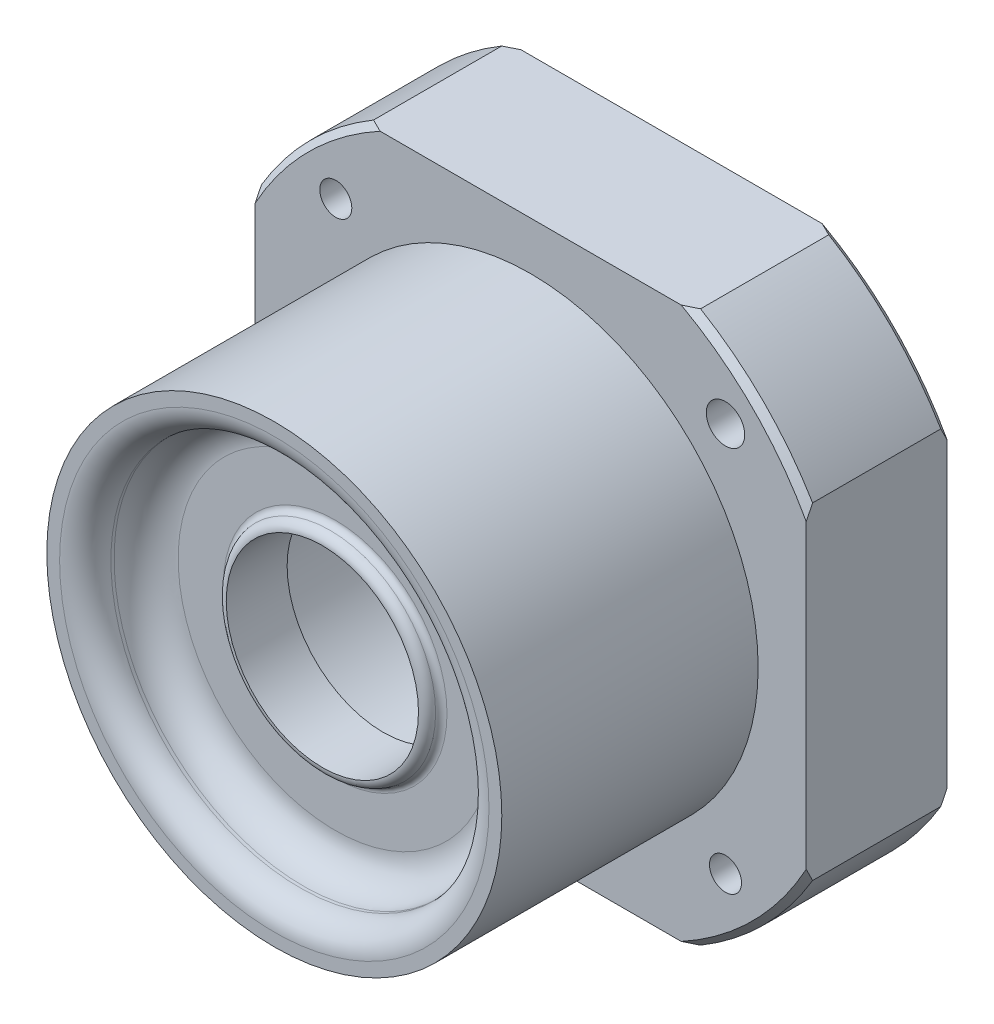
ISO-10303-21;
HEADER;
FILE_DESCRIPTION(('STEP AP214'),'2;1');
FILE_NAME('part.step','',(''),(''),'','','');
FILE_SCHEMA(('AUTOMOTIVE_DESIGN { 1 0 10303 214 1 1 1 1 }'));
ENDSEC;
DATA;
#1=APPLICATION_CONTEXT('core data for automotive mechanical design processes');
#2=APPLICATION_PROTOCOL_DEFINITION('international standard','automotive_design',2000,#1);
#3=PRODUCT_CONTEXT('',#1,'mechanical');
#4=PRODUCT('Part','Part','',(#3));
#5=PRODUCT_RELATED_PRODUCT_CATEGORY('part','',(#4));
#6=PRODUCT_DEFINITION_FORMATION('','',#4);
#7=PRODUCT_DEFINITION_CONTEXT('part definition',#1,'design');
#8=PRODUCT_DEFINITION('design','',#6,#7);
#9=PRODUCT_DEFINITION_SHAPE('','',#8);
#10=(LENGTH_UNIT() NAMED_UNIT(*) SI_UNIT(.MILLI.,.METRE.));
#11=(NAMED_UNIT(*) PLANE_ANGLE_UNIT() SI_UNIT($,.RADIAN.));
#12=(NAMED_UNIT(*) SI_UNIT($,.STERADIAN.) SOLID_ANGLE_UNIT());
#13=UNCERTAINTY_MEASURE_WITH_UNIT(LENGTH_MEASURE(1.E-05),#10,'distance_accuracy_value','');
#14=(GEOMETRIC_REPRESENTATION_CONTEXT(3) GLOBAL_UNCERTAINTY_ASSIGNED_CONTEXT((#13)) GLOBAL_UNIT_ASSIGNED_CONTEXT((#10,
#11,#12)) REPRESENTATION_CONTEXT('',''));
#15=CARTESIAN_POINT('',(0.,0.,0.));
#16=DIRECTION('',(0.,0.,1.));
#17=DIRECTION('',(1.,0.,0.));
#18=AXIS2_PLACEMENT_3D('',#15,#16,#17);
#19=CARTESIAN_POINT('',(0.,0.,-22.));
#20=DIRECTION('',(0.,0.,-1.));
#21=DIRECTION('',(-1.,0.,0.));
#22=AXIS2_PLACEMENT_3D('',#19,#20,#21);
#23=PLANE('',#22);
#24=CARTESIAN_POINT('',(-30.4055915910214,-30.4055915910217,-22.));
#25=DIRECTION('',(0.,0.,1.));
#26=DIRECTION('',(-1.,0.,0.));
#27=AXIS2_PLACEMENT_3D('',#24,#25,#26);
#28=CIRCLE('',#27,2.99999999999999);
#29=CARTESIAN_POINT('',(-33.4055915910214,-30.4055915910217,-22.));
#30=VERTEX_POINT('',#29);
#31=EDGE_CURVE('E507',#30,#30,#28,.T.);
#32=ORIENTED_EDGE('',*,*,#31,.T.);
#33=EDGE_LOOP('',(#32));
#34=FACE_BOUND('',#33,.T.);
#35=CARTESIAN_POINT('',(30.4055915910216,30.4055915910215,-22.));
#36=DIRECTION('',(0.,0.,1.));
#37=DIRECTION('',(1.,0.,0.));
#38=AXIS2_PLACEMENT_3D('',#35,#36,#37);
#39=CIRCLE('',#38,2.99999999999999);
#40=CARTESIAN_POINT('',(33.4055915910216,30.4055915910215,-22.));
#41=VERTEX_POINT('',#40);
#42=EDGE_CURVE('E503',#41,#41,#39,.T.);
#43=ORIENTED_EDGE('',*,*,#42,.T.);
#44=EDGE_LOOP('',(#43));
#45=FACE_BOUND('',#44,.T.);
#46=CARTESIAN_POINT('',(-30.4055915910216,30.4055915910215,-22.));
#47=DIRECTION('',(0.,0.,1.));
#48=DIRECTION('',(1.,0.,0.));
#49=AXIS2_PLACEMENT_3D('',#46,#47,#48);
#50=CIRCLE('',#49,2.5);
#51=CARTESIAN_POINT('',(-27.9055915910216,30.4055915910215,-22.));
#52=VERTEX_POINT('',#51);
#53=EDGE_CURVE('E495',#52,#52,#50,.T.);
#54=ORIENTED_EDGE('',*,*,#53,.T.);
#55=EDGE_LOOP('',(#54));
#56=FACE_BOUND('',#55,.T.);
#57=DIRECTION('',(1.,0.,0.));
#58=VECTOR('',#57,1.);
#59=CARTESIAN_POINT('',(0.,-43.,-22.));
#60=LINE('',#59,#58);
#61=CARTESIAN_POINT('',(-23.4946802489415,-43.,-22.));
#62=VERTEX_POINT('',#61);
#63=CARTESIAN_POINT('',(23.4946802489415,-43.,-22.));
#64=VERTEX_POINT('',#63);
#65=EDGE_CURVE('E148',#62,#64,#60,.T.);
#66=ORIENTED_EDGE('',*,*,#65,.F.);
#67=CARTESIAN_POINT('',(0.,0.,-22.));
#68=DIRECTION('',(0.,0.,-1.));
#69=DIRECTION('',(-1.,0.,0.));
#70=AXIS2_PLACEMENT_3D('',#67,#68,#69);
#71=CIRCLE('',#70,49.);
#72=CARTESIAN_POINT('',(-43.,-23.4946802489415,-22.));
#73=VERTEX_POINT('',#72);
#74=EDGE_CURVE('E155',#62,#73,#71,.T.);
#75=ORIENTED_EDGE('',*,*,#74,.T.);
#76=DIRECTION('',(0.,-1.,0.));
#77=VECTOR('',#76,1.);
#78=CARTESIAN_POINT('',(-43.,0.,-22.));
#79=LINE('',#78,#77);
#80=CARTESIAN_POINT('',(-43.,23.4946802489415,-22.));
#81=VERTEX_POINT('',#80);
#82=EDGE_CURVE('E341',#81,#73,#79,.T.);
#83=ORIENTED_EDGE('',*,*,#82,.F.);
#84=CARTESIAN_POINT('',(-23.4946802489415,43.,-22.));
#85=VERTEX_POINT('',#84);
#86=EDGE_CURVE('E157',#81,#85,#71,.T.);
#87=ORIENTED_EDGE('',*,*,#86,.T.);
#88=DIRECTION('',(1.,0.,0.));
#89=VECTOR('',#88,1.);
#90=CARTESIAN_POINT('',(0.,43.,-22.));
#91=LINE('',#90,#89);
#92=CARTESIAN_POINT('',(23.4946802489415,43.,-22.));
#93=VERTEX_POINT('',#92);
#94=EDGE_CURVE('E359',#85,#93,#91,.T.);
#95=ORIENTED_EDGE('',*,*,#94,.T.);
#96=CARTESIAN_POINT('',(43.,23.4946802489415,-22.));
#97=VERTEX_POINT('',#96);
#98=EDGE_CURVE('E154',#93,#97,#71,.T.);
#99=ORIENTED_EDGE('',*,*,#98,.T.);
#100=DIRECTION('',(0.,-1.,0.));
#101=VECTOR('',#100,1.);
#102=CARTESIAN_POINT('',(43.,0.,-22.));
#103=LINE('',#102,#101);
#104=CARTESIAN_POINT('',(43.,-23.4946802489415,-22.));
#105=VERTEX_POINT('',#104);
#106=EDGE_CURVE('E151',#97,#105,#103,.T.);
#107=ORIENTED_EDGE('',*,*,#106,.T.);
#108=EDGE_CURVE('E144',#105,#64,#71,.T.);
#109=ORIENTED_EDGE('',*,*,#108,.T.);
#110=EDGE_LOOP('',(#66,#75,#83,#87,#95,#99,#107,#109));
#111=FACE_BOUND('',#110,.T.);
#112=CARTESIAN_POINT('',(0.,0.,-22.));
#113=DIRECTION('',(0.,0.,-1.));
#114=DIRECTION('',(-1.,0.,0.));
#115=AXIS2_PLACEMENT_3D('',#112,#113,#114);
#116=CIRCLE('',#115,20.);
#117=CARTESIAN_POINT('',(-20.,0.,-22.));
#118=VERTEX_POINT('',#117);
#119=EDGE_CURVE('E396',#118,#118,#116,.T.);
#120=ORIENTED_EDGE('',*,*,#119,.F.);
#121=EDGE_LOOP('',(#120));
#122=FACE_BOUND('',#121,.T.);
#123=CARTESIAN_POINT('',(30.4055915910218,-30.4055915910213,-22.));
#124=DIRECTION('',(0.,0.,1.));
#125=DIRECTION('',(1.,0.,0.));
#126=AXIS2_PLACEMENT_3D('',#123,#124,#125);
#127=CIRCLE('',#126,2.5);
#128=CARTESIAN_POINT('',(32.9055915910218,-30.4055915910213,-22.));
#129=VERTEX_POINT('',#128);
#130=EDGE_CURVE('E500',#129,#129,#127,.T.);
#131=ORIENTED_EDGE('',*,*,#130,.T.);
#132=EDGE_LOOP('',(#131));
#133=FACE_BOUND('',#132,.T.);
#134=ADVANCED_FACE('F29',(#34,#45,#56,#111,#122,#133),#23,.T.);
#135=CARTESIAN_POINT('',(0.,0.,-1.00000000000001));
#136=DIRECTION('',(0.,0.,-1.));
#137=DIRECTION('',(-1.,0.,0.));
#138=AXIS2_PLACEMENT_3D('',#135,#136,#137);
#139=CONICAL_SURFACE('',#138,50.,0.785398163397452);
#140=CARTESIAN_POINT('',(-8.15717491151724,-43.,5.23312322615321));
#141=CARTESIAN_POINT('',(-8.58514671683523,-43.,5.15336346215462));
#142=CARTESIAN_POINT('',(-9.01199768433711,-43.,5.06774335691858));
#143=CARTESIAN_POINT('',(-9.86325765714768,-43.,4.88525065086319));
#144=CARTESIAN_POINT('',(-10.2876668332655,-43.,4.78837884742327));
#145=CARTESIAN_POINT('',(-11.5565143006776,-43.,4.48169254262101));
#146=CARTESIAN_POINT('',(-12.3970864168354,-43.,4.25571033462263));
#147=CARTESIAN_POINT('',(-14.0637832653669,-43.,3.76552762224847));
#148=CARTESIAN_POINT('',(-14.8899475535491,-43.,3.50146036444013));
#149=CARTESIAN_POINT('',(-16.5304204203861,-43.,2.93850728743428));
#150=CARTESIAN_POINT('',(-17.3447272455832,-43.,2.63961637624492));
#151=CARTESIAN_POINT('',(-18.9530646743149,-43.,2.01409476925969));
#152=CARTESIAN_POINT('',(-19.7472171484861,-43.,1.68777605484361));
#153=CARTESIAN_POINT('',(-21.3238831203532,-43.,1.00831386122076));
#154=CARTESIAN_POINT('',(-22.1063971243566,-43.,0.655171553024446));
#155=CARTESIAN_POINT('',(-23.6609206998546,-43.,-0.0751252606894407));
#156=CARTESIAN_POINT('',(-24.4329207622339,-43.,-0.45229995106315));
#157=CARTESIAN_POINT('',(-25.9663085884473,-43.,-1.22759932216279));
#158=CARTESIAN_POINT('',(-26.7276962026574,-43.,-1.62572429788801));
#159=CARTESIAN_POINT('',(-28.5763576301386,-43.,-2.62131925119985));
#160=CARTESIAN_POINT('',(-29.6582332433,-43.,-3.22881594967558));
#161=CARTESIAN_POINT('',(-31.8032993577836,-43.,-4.47605616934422));
#162=CARTESIAN_POINT('',(-32.8664877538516,-43.,-5.11580329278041));
#163=CARTESIAN_POINT('',(-34.9765046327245,-43.,-6.42264482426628));
#164=CARTESIAN_POINT('',(-36.0233259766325,-43.,-7.08975072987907));
#165=CARTESIAN_POINT('',(-38.1019471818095,-43.,-8.44683421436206));
#166=CARTESIAN_POINT('',(-39.1337475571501,-43.,-9.13681100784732));
#167=CARTESIAN_POINT('',(-41.1864051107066,-43.,-10.5378545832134));
#168=CARTESIAN_POINT('',(-42.2072314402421,-43.,-11.2489664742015));
#169=CARTESIAN_POINT('',(-44.2370084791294,-43.,-12.6879295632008));
#170=CARTESIAN_POINT('',(-45.2459591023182,-43.,-13.4157808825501));
#171=CARTESIAN_POINT('',(-47.2530721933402,-43.,-14.8857265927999));
#172=CARTESIAN_POINT('',(-48.2512370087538,-43.,-15.6278177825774));
#173=CARTESIAN_POINT('',(-50.2381579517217,-43.,-17.1244706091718));
#174=CARTESIAN_POINT('',(-51.226914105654,-43.,-17.8790322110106));
#175=CARTESIAN_POINT('',(-53.228822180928,-43.,-19.4243321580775));
#176=CARTESIAN_POINT('',(-54.2416898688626,-43.,-20.2154383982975));
#177=CARTESIAN_POINT('',(-56.2594350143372,-43.,-21.8077689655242));
#178=CARTESIAN_POINT('',(-57.264312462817,-43.,-22.6089933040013));
#179=CARTESIAN_POINT('',(-59.2670009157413,-43.,-24.2203787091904));
#180=CARTESIAN_POINT('',(-60.2648113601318,-43.,-25.0305404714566));
#181=CARTESIAN_POINT('',(-62.2540274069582,-43.,-26.6586904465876));
#182=CARTESIAN_POINT('',(-63.2454329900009,-43.,-27.4766786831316));
#183=CARTESIAN_POINT('',(-65.2159951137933,-43.,-29.1141958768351));
#184=CARTESIAN_POINT('',(-66.1951893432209,-43.,-29.9336795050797));
#185=CARTESIAN_POINT('',(-68.1484463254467,-43.,-31.5787414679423));
#186=CARTESIAN_POINT('',(-69.1225090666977,-43.,-32.404319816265));
#187=CARTESIAN_POINT('',(-71.0658032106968,-43.,-34.0607612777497));
#188=CARTESIAN_POINT('',(-72.0350355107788,-43.,-34.8916233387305));
#189=CARTESIAN_POINT('',(-73.9692680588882,-43.,-36.5582414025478));
#190=CARTESIAN_POINT('',(-74.9342683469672,-43.,-37.393997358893));
#191=CARTESIAN_POINT('',(-75.8973666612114,-43.,-38.2319337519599));
#192=B_SPLINE_CURVE_WITH_KNOTS('',3,(#140,#141,#142,#143,#144,#145,#146,#147,#148,#149,#150,
#151,#152,#153,#154,#155,#156,#157,#158,#159,#160,#161,#162,#163,#164,#165,#166,#167,#168,#169,
#170,#171,#172,#173,#174,#175,#176,#177,#178,#179,#180,#181,#182,#183,#184,#185,#186,#187,#188,
#189,#190,#191),.UNSPECIFIED.,.F.,.F.,(4,2,2,2,2,2,2,2,2,2,2,2,2,2,2,2,2,2,2,2,2,2,2,2,2,4),(0.,
1.30593129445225,2.61177009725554,5.22188084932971,7.82307179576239,10.4246435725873,
12.9998378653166,15.5749197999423,18.1521938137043,20.72950412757,24.4511016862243,
28.1731158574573,31.8967105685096,35.6201775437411,39.3522609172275,43.0843713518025,
46.8156524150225,50.5469230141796,54.402462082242,58.2580055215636,62.1138511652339,
65.9697084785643,69.8002648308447,73.6308297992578,77.4606544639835,81.2904428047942),.UNSPECIFIED.);
#193=CARTESIAN_POINT('',(-23.4946802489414,-43.,0.));
#194=VERTEX_POINT('',#193);
#195=CARTESIAN_POINT('',(-25.5147016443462,-43.,-1.00000000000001));
#196=VERTEX_POINT('',#195);
#197=EDGE_CURVE('E52',#194,#196,#192,.T.);
#198=ORIENTED_EDGE('',*,*,#197,.F.);
#199=CARTESIAN_POINT('',(0.,0.,0.));
#200=DIRECTION('',(0.,0.,-1.));
#201=DIRECTION('',(-1.,0.,0.));
#202=AXIS2_PLACEMENT_3D('',#199,#200,#201);
#203=CIRCLE('',#202,49.);
#204=CARTESIAN_POINT('',(-43.,-23.4946802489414,0.));
#205=VERTEX_POINT('',#204);
#206=EDGE_CURVE('E420',#205,#194,#203,.F.);
#207=ORIENTED_EDGE('',*,*,#206,.F.);
#208=CARTESIAN_POINT('',(-43.,-78.224166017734,-40.2637672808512));
#209=CARTESIAN_POINT('',(-43.,-77.248382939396,-39.4086827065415));
#210=CARTESIAN_POINT('',(-43.,-76.270775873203,-38.555674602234));
#211=CARTESIAN_POINT('',(-43.,-74.3115064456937,-36.8543128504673));
#212=CARTESIAN_POINT('',(-43.,-73.3298440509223,-36.0059592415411));
#213=CARTESIAN_POINT('',(-43.,-71.3619078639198,-34.3142803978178));
#214=CARTESIAN_POINT('',(-43.,-70.3756333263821,-33.47095602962));
#215=CARTESIAN_POINT('',(-43.,-68.3981711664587,-31.7900889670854));
#216=CARTESIAN_POINT('',(-43.,-67.4069835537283,-30.9525462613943));
#217=CARTESIAN_POINT('',(-43.,-65.4135731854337,-29.2792466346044));
#218=CARTESIAN_POINT('',(-43.,-64.4113197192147,-28.443526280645));
#219=CARTESIAN_POINT('',(-43.,-62.4006984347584,-26.7794744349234));
#220=CARTESIAN_POINT('',(-43.,-61.3923306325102,-25.9511429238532));
#221=CARTESIAN_POINT('',(-43.,-59.3688454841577,-24.302901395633));
#222=CARTESIAN_POINT('',(-43.,-58.3537286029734,-23.4829908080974));
#223=CARTESIAN_POINT('',(-43.,-56.3158731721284,-21.8526906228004));
#224=CARTESIAN_POINT('',(-43.,-55.2931346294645,-21.0423010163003));
#225=CARTESIAN_POINT('',(-43.,-53.2686027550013,-19.4555346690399));
#226=CARTESIAN_POINT('',(-43.,-52.2670513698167,-18.6788494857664));
#227=CARTESIAN_POINT('',(-43.,-50.2549069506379,-17.1372629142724));
#228=CARTESIAN_POINT('',(-43.,-49.2443138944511,-16.3723615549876));
#229=CARTESIAN_POINT('',(-43.,-47.2127745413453,-14.8560018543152));
#230=CARTESIAN_POINT('',(-43.,-46.1918262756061,-14.1045461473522));
#231=CARTESIAN_POINT('',(-43.,-44.1384950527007,-12.6174124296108));
#232=CARTESIAN_POINT('',(-43.,-43.1061121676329,-11.8817343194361));
#233=CARTESIAN_POINT('',(-43.,-41.030440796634,-10.4301917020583));
#234=CARTESIAN_POINT('',(-43.,-39.9871770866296,-9.71429182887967));
#235=CARTESIAN_POINT('',(-43.,-37.8861167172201,-8.30402520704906));
#236=CARTESIAN_POINT('',(-43.,-36.8283196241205,-7.60965910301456));
#237=CARTESIAN_POINT('',(-43.,-34.6967758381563,-6.24667411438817));
#238=CARTESIAN_POINT('',(-43.,-33.6230351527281,-5.5780458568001));
#239=CARTESIAN_POINT('',(-43.,-31.4572914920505,-4.27114939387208));
#240=CARTESIAN_POINT('',(-43.,-30.3652902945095,-3.63287825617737));
#241=CARTESIAN_POINT('',(-43.,-28.4895532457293,-2.57757410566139));
#242=CARTESIAN_POINT('',(-43.,-27.7110015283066,-2.15132714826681));
#243=CARTESIAN_POINT('',(-43.,-26.1430916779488,-1.3191777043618));
#244=CARTESIAN_POINT('',(-43.,-25.353733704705,-0.913274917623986));
#245=CARTESIAN_POINT('',(-43.,-23.7641696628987,-0.124942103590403));
#246=CARTESIAN_POINT('',(-43.,-22.9639735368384,0.257507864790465));
#247=CARTESIAN_POINT('',(-43.,-21.3515549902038,0.996091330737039));
#248=CARTESIAN_POINT('',(-43.,-20.5393320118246,1.35222360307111));
#249=CARTESIAN_POINT('',(-43.,-18.0686085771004,2.38220011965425));
#250=CARTESIAN_POINT('',(-43.,-16.3903621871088,3.0103873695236));
#251=CARTESIAN_POINT('',(-43.,-13.8327407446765,3.83705299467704));
#252=CARTESIAN_POINT('',(-43.,-12.9719717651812,4.09368128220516));
#253=CARTESIAN_POINT('',(-43.,-11.2381812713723,4.56354336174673));
#254=CARTESIAN_POINT('',(-43.,-10.3651530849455,4.77675246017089));
#255=CARTESIAN_POINT('',(-43.,-9.48661747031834,4.96596871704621));
#256=B_SPLINE_CURVE_WITH_KNOTS('',3,(#208,#209,#210,#211,#212,#213,#214,#215,#216,#217,#218,
#219,#220,#221,#222,#223,#224,#225,#226,#227,#228,#229,#230,#231,#232,#233,#234,#235,#236,#237,
#238,#239,#240,#241,#242,#243,#244,#245,#246,#247,#248,#249,#250,#251,#252,#253,#254,#255),
.UNSPECIFIED.,.F.,.F.,(4,2,2,2,2,2,2,2,2,2,2,2,2,2,2,2,2,2,2,2,2,2,2,4),(0.,3.89228919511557,
7.78461056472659,11.6775842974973,15.5705503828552,19.4854219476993,23.4002832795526,
27.3148776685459,31.22946846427,35.0316426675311,38.8338262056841,42.636746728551,
46.4396432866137,50.2352302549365,54.0309307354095,57.8252355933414,61.6191731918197,
64.281707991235,66.9442034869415,69.6044028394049,72.2647259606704,77.6333844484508,
80.3270233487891,83.0221899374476),.UNSPECIFIED.);
#257=CARTESIAN_POINT('',(-43.,-25.5147016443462,-1.00000000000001));
#258=VERTEX_POINT('',#257);
#259=EDGE_CURVE('E251',#258,#205,#256,.T.);
#260=ORIENTED_EDGE('',*,*,#259,.F.);
#261=CARTESIAN_POINT('',(0.,0.,-1.00000000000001));
#262=DIRECTION('',(0.,0.,-1.));
#263=DIRECTION('',(-1.,0.,0.));
#264=AXIS2_PLACEMENT_3D('',#261,#262,#263);
#265=CIRCLE('',#264,50.);
#266=EDGE_CURVE('E304',#196,#258,#265,.T.);
#267=ORIENTED_EDGE('',*,*,#266,.F.);
#268=EDGE_LOOP('',(#198,#207,#260,#267));
#269=FACE_BOUND('',#268,.T.);
#270=ADVANCED_FACE('F226',(#269),#139,.T.);
#271=CARTESIAN_POINT('',(0.,0.,-22.));
#272=DIRECTION('',(0.,0.,1.));
#273=DIRECTION('',(1.,0.,0.));
#274=AXIS2_PLACEMENT_3D('',#271,#272,#273);
#275=CONICAL_SURFACE('',#274,49.,0.785398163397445);
#276=CARTESIAN_POINT('',(-75.8973666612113,-43.,16.2319337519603));
#277=CARTESIAN_POINT('',(-74.9342683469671,-43.,15.3939973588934));
#278=CARTESIAN_POINT('',(-73.9692680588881,-43.,14.5582414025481));
#279=CARTESIAN_POINT('',(-72.0350355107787,-43.,12.8916233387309));
#280=CARTESIAN_POINT('',(-71.0658032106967,-43.,12.0607612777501));
#281=CARTESIAN_POINT('',(-69.1225090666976,-43.,10.4043198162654));
#282=CARTESIAN_POINT('',(-68.1484463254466,-43.,9.57874146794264));
#283=CARTESIAN_POINT('',(-66.1951893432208,-43.,7.93367950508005));
#284=CARTESIAN_POINT('',(-65.2159951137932,-43.,7.11419587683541));
#285=CARTESIAN_POINT('',(-63.2454329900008,-43.,5.4766786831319));
#286=CARTESIAN_POINT('',(-62.2540274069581,-43.,4.6586904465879));
#287=CARTESIAN_POINT('',(-60.2648113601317,-43.,3.03054047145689));
#288=CARTESIAN_POINT('',(-59.2670009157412,-43.,2.22037870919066));
#289=CARTESIAN_POINT('',(-57.2643124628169,-43.,0.608993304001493));
#290=CARTESIAN_POINT('',(-56.2594350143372,-43.,-0.192231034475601));
#291=CARTESIAN_POINT('',(-54.2416898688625,-43.,-1.78456160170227));
#292=CARTESIAN_POINT('',(-53.2288221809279,-43.,-2.57566784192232));
#293=CARTESIAN_POINT('',(-51.226914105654,-43.,-4.1209677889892));
#294=CARTESIAN_POINT('',(-50.2381579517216,-43.,-4.87552939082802));
#295=CARTESIAN_POINT('',(-48.2512370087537,-43.,-6.37218221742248));
#296=CARTESIAN_POINT('',(-47.2530721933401,-43.,-7.11427340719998));
#297=CARTESIAN_POINT('',(-45.2459591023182,-43.,-8.58421911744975));
#298=CARTESIAN_POINT('',(-44.2370084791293,-43.,-9.31207043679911));
#299=CARTESIAN_POINT('',(-42.207231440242,-43.,-10.7510335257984));
#300=CARTESIAN_POINT('',(-41.1864051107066,-43.,-11.4621454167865));
#301=CARTESIAN_POINT('',(-39.1337475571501,-43.,-12.8631889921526));
#302=CARTESIAN_POINT('',(-38.1019471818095,-43.,-13.5531657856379));
#303=CARTESIAN_POINT('',(-36.0233259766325,-43.,-14.9102492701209));
#304=CARTESIAN_POINT('',(-34.9765046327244,-43.,-15.5773551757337));
#305=CARTESIAN_POINT('',(-32.8664877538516,-43.,-16.8841967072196));
#306=CARTESIAN_POINT('',(-31.8032993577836,-43.,-17.5239438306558));
#307=CARTESIAN_POINT('',(-29.6582332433,-43.,-18.7711840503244));
#308=CARTESIAN_POINT('',(-28.5763576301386,-43.,-19.3786807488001));
#309=CARTESIAN_POINT('',(-26.7276962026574,-43.,-20.374275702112));
#310=CARTESIAN_POINT('',(-25.9663085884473,-43.,-20.7724006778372));
#311=CARTESIAN_POINT('',(-24.4329207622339,-43.,-21.5477000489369));
#312=CARTESIAN_POINT('',(-23.6609206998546,-43.,-21.9248747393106));
#313=CARTESIAN_POINT('',(-22.1063971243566,-43.,-22.6551715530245));
#314=CARTESIAN_POINT('',(-21.3238831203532,-43.,-23.0083138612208));
#315=CARTESIAN_POINT('',(-19.7472171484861,-43.,-23.6877760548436));
#316=CARTESIAN_POINT('',(-18.9530646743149,-43.,-24.0140947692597));
#317=CARTESIAN_POINT('',(-17.3447272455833,-43.,-24.639616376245));
#318=CARTESIAN_POINT('',(-16.5304204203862,-43.,-24.9385072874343));
#319=CARTESIAN_POINT('',(-14.8899475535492,-43.,-25.5014603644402));
#320=CARTESIAN_POINT('',(-14.063783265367,-43.,-25.7655276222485));
#321=CARTESIAN_POINT('',(-12.3970864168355,-43.,-26.2557103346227));
#322=CARTESIAN_POINT('',(-11.5565143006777,-43.,-26.4816925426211));
#323=CARTESIAN_POINT('',(-10.2876668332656,-43.,-26.7883788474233));
#324=CARTESIAN_POINT('',(-9.86325765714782,-43.,-26.8852506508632));
#325=CARTESIAN_POINT('',(-9.01199768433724,-43.,-27.0677433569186));
#326=CARTESIAN_POINT('',(-8.58514671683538,-43.,-27.1533634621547));
#327=CARTESIAN_POINT('',(-8.15717491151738,-43.,-27.2331232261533));
#328=B_SPLINE_CURVE_WITH_KNOTS('',3,(#276,#277,#278,#279,#280,#281,#282,#283,#284,#285,#286,
#287,#288,#289,#290,#291,#292,#293,#294,#295,#296,#297,#298,#299,#300,#301,#302,#303,#304,#305,
#306,#307,#308,#309,#310,#311,#312,#313,#314,#315,#316,#317,#318,#319,#320,#321,#322,#323,#324,
#325,#326,#327),.UNSPECIFIED.,.F.,.F.,(4,2,2,2,2,2,2,2,2,2,2,2,2,2,2,2,2,2,2,2,2,2,2,2,2,4),(0.,
3.82978834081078,7.6596130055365,11.4901779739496,15.32073432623,19.1765916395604,
23.0324372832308,26.8879807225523,30.7435197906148,34.4747903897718,38.2060714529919,
41.9381818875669,45.6702652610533,49.3937322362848,53.1173269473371,56.8393411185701,
60.5609386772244,63.1382489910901,65.715523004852,68.2906049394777,70.865799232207,
73.4673710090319,76.0685619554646,78.6786727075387,79.984511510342,81.2904428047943),.UNSPECIFIED.);
#329=CARTESIAN_POINT('',(-25.5147016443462,-43.,-21.));
#330=VERTEX_POINT('',#329);
#331=EDGE_CURVE('E165',#330,#62,#328,.T.);
#332=ORIENTED_EDGE('',*,*,#331,.F.);
#333=CARTESIAN_POINT('',(0.,0.,-21.));
#334=DIRECTION('',(0.,0.,-1.));
#335=DIRECTION('',(-1.,0.,0.));
#336=AXIS2_PLACEMENT_3D('',#333,#334,#335);
#337=CIRCLE('',#336,50.);
#338=CARTESIAN_POINT('',(-43.,-25.5147016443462,-21.));
#339=VERTEX_POINT('',#338);
#340=EDGE_CURVE('E307',#339,#330,#337,.F.);
#341=ORIENTED_EDGE('',*,*,#340,.F.);
#342=CARTESIAN_POINT('',(-43.,-9.48661747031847,-26.9659687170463));
#343=CARTESIAN_POINT('',(-43.,-10.3651530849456,-26.7767524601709));
#344=CARTESIAN_POINT('',(-43.,-11.2381812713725,-26.5635433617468));
#345=CARTESIAN_POINT('',(-43.,-12.9719717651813,-26.0936812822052));
#346=CARTESIAN_POINT('',(-43.,-13.8327407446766,-25.8370529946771));
#347=CARTESIAN_POINT('',(-43.,-16.3903621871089,-25.0103873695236));
#348=CARTESIAN_POINT('',(-43.,-18.0686085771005,-24.3822001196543));
#349=CARTESIAN_POINT('',(-43.,-20.5393320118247,-23.3522236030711));
#350=CARTESIAN_POINT('',(-43.,-21.3515549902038,-22.9960913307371));
#351=CARTESIAN_POINT('',(-43.,-22.9639735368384,-22.2575078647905));
#352=CARTESIAN_POINT('',(-43.,-23.7641696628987,-21.8750578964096));
#353=CARTESIAN_POINT('',(-43.,-25.353733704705,-21.086725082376));
#354=CARTESIAN_POINT('',(-43.,-26.1430916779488,-20.6808222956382));
#355=CARTESIAN_POINT('',(-43.,-27.7110015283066,-19.8486728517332));
#356=CARTESIAN_POINT('',(-43.,-28.4895532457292,-19.4224258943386));
#357=CARTESIAN_POINT('',(-43.,-30.3652902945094,-18.3671217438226));
#358=CARTESIAN_POINT('',(-43.,-31.4572914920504,-17.7288506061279));
#359=CARTESIAN_POINT('',(-43.,-33.6230351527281,-16.4219541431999));
#360=CARTESIAN_POINT('',(-43.,-34.6967758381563,-15.7533258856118));
#361=CARTESIAN_POINT('',(-43.,-36.8283196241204,-14.3903408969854));
#362=CARTESIAN_POINT('',(-43.,-37.88611671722,-13.6959747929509));
#363=CARTESIAN_POINT('',(-43.,-39.9871770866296,-12.2857081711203));
#364=CARTESIAN_POINT('',(-43.,-41.0304407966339,-11.5698082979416));
#365=CARTESIAN_POINT('',(-43.,-43.1061121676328,-10.1182656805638));
#366=CARTESIAN_POINT('',(-43.,-44.1384950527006,-9.38258757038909));
#367=CARTESIAN_POINT('',(-43.,-46.191826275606,-7.89545385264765));
#368=CARTESIAN_POINT('',(-43.,-47.2127745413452,-7.14399814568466));
#369=CARTESIAN_POINT('',(-43.,-49.244313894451,-5.62763844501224));
#370=CARTESIAN_POINT('',(-43.,-50.2549069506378,-4.86273708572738));
#371=CARTESIAN_POINT('',(-43.,-52.2670513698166,-3.32115051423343));
#372=CARTESIAN_POINT('',(-43.,-53.2686027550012,-2.54446533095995));
#373=CARTESIAN_POINT('',(-43.,-55.2931346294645,-0.957698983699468));
#374=CARTESIAN_POINT('',(-43.,-56.3158731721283,-0.147309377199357));
#375=CARTESIAN_POINT('',(-43.,-58.3537286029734,1.4829908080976));
#376=CARTESIAN_POINT('',(-43.,-59.3688454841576,2.30290139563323));
#377=CARTESIAN_POINT('',(-43.,-61.3923306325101,3.95114292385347));
#378=CARTESIAN_POINT('',(-43.,-62.4006984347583,4.77947443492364));
#379=CARTESIAN_POINT('',(-43.,-64.4113197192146,6.4435262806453));
#380=CARTESIAN_POINT('',(-43.,-65.4135731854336,7.27924663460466));
#381=CARTESIAN_POINT('',(-43.,-67.4069835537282,8.95254626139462));
#382=CARTESIAN_POINT('',(-43.,-68.3981711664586,9.79008896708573));
#383=CARTESIAN_POINT('',(-43.,-70.375633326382,11.4709560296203));
#384=CARTESIAN_POINT('',(-43.,-71.3619078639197,12.3142803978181));
#385=CARTESIAN_POINT('',(-43.,-73.3298440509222,14.0059592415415));
#386=CARTESIAN_POINT('',(-43.,-74.3115064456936,14.8543128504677));
#387=CARTESIAN_POINT('',(-43.,-76.2707758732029,16.5556746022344));
#388=CARTESIAN_POINT('',(-43.,-77.2483829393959,17.4086827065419));
#389=CARTESIAN_POINT('',(-43.,-78.2241660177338,18.2637672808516));
#390=B_SPLINE_CURVE_WITH_KNOTS('',3,(#342,#343,#344,#345,#346,#347,#348,#349,#350,#351,#352,
#353,#354,#355,#356,#357,#358,#359,#360,#361,#362,#363,#364,#365,#366,#367,#368,#369,#370,#371,
#372,#373,#374,#375,#376,#377,#378,#379,#380,#381,#382,#383,#384,#385,#386,#387,#388,#389),
.UNSPECIFIED.,.F.,.F.,(4,2,2,2,2,2,2,2,2,2,2,2,2,2,2,2,2,2,2,2,2,2,2,4),(0.,2.69516658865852,
5.38880548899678,10.7574639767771,13.4177870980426,16.077986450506,18.7404819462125,
21.4030167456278,25.1969543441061,28.991259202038,32.786959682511,36.5825466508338,
40.3854432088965,44.1883637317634,47.9905472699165,51.7927214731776,55.7073122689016,
59.6219066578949,63.5367679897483,67.4516395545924,71.3446056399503,75.237579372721,
79.1299007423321,83.0221899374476),.UNSPECIFIED.);
#391=EDGE_CURVE('E173',#73,#339,#390,.T.);
#392=ORIENTED_EDGE('',*,*,#391,.F.);
#393=ORIENTED_EDGE('',*,*,#74,.F.);
#394=EDGE_LOOP('',(#332,#341,#392,#393));
#395=FACE_BOUND('',#394,.T.);
#396=ADVANCED_FACE('F362',(#395),#275,.T.);
#397=CARTESIAN_POINT('',(0.,0.,-22.));
#398=DIRECTION('',(0.,0.,1.));
#399=DIRECTION('',(1.,0.,0.));
#400=AXIS2_PLACEMENT_3D('',#397,#398,#399);
#401=CYLINDRICAL_SURFACE('',#400,50.);
#402=ORIENTED_EDGE('',*,*,#340,.T.);
#403=DIRECTION('',(0.,0.,1.));
#404=VECTOR('',#403,1.);
#405=CARTESIAN_POINT('',(-25.5147016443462,-43.,-22.));
#406=LINE('',#405,#404);
#407=EDGE_CURVE('E276',#330,#196,#406,.T.);
#408=ORIENTED_EDGE('',*,*,#407,.T.);
#409=ORIENTED_EDGE('',*,*,#266,.T.);
#410=DIRECTION('',(0.,0.,1.));
#411=VECTOR('',#410,1.);
#412=CARTESIAN_POINT('',(-43.,-25.5147016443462,-22.));
#413=LINE('',#412,#411);
#414=EDGE_CURVE('E216',#258,#339,#413,.F.);
#415=ORIENTED_EDGE('',*,*,#414,.T.);
#416=EDGE_LOOP('',(#402,#408,#409,#415));
#417=FACE_BOUND('',#416,.T.);
#418=ADVANCED_FACE('F303',(#417),#401,.T.);
#419=CARTESIAN_POINT('',(80.0967562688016,-43.,-41.9092424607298));
#420=CARTESIAN_POINT('',(79.1102516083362,-43.,-41.0400885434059));
#421=CARTESIAN_POINT('',(78.121980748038,-43.,-40.1729347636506));
#422=CARTESIAN_POINT('',(76.1415144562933,-43.,-38.443106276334));
#423=CARTESIAN_POINT('',(75.149318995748,-43.,-37.580431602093));
#424=CARTESIAN_POINT('',(73.1604768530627,-43.,-35.8599240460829));
#425=CARTESIAN_POINT('',(72.1638295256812,-43.,-35.0020919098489));
#426=CARTESIAN_POINT('',(70.1657831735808,-43.,-33.2919808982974));
#427=CARTESIAN_POINT('',(69.1643841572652,-43.,-32.4397020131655));
#428=CARTESIAN_POINT('',(67.151334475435,-43.,-30.7371422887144));
#429=CARTESIAN_POINT('',(66.1396575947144,-43.,-29.8868924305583));
#430=CARTESIAN_POINT('',(64.1104023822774,-43.,-28.1934654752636));
#431=CARTESIAN_POINT('',(63.0928240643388,-43.,-27.3502883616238));
#432=CARTESIAN_POINT('',(61.0511511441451,-43.,-25.671983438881));
#433=CARTESIAN_POINT('',(60.0270569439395,-43.,-24.8368551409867));
#434=CARTESIAN_POINT('',(57.9715168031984,-43.,-23.1756902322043));
#435=CARTESIAN_POINT('',(56.9400708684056,-43.,-22.3496536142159));
#436=CARTESIAN_POINT('',(54.8960202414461,-43.,-20.7294412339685));
#437=CARTESIAN_POINT('',(53.8836283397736,-43.,-19.934997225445));
#438=CARTESIAN_POINT('',(51.8500763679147,-43.,-18.3573954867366));
#439=CARTESIAN_POINT('',(50.8289162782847,-43.,-17.5742377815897));
#440=CARTESIAN_POINT('',(48.7765633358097,-43.,-16.0207908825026));
#441=CARTESIAN_POINT('',(47.7453687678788,-43.,-15.250503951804));
#442=CARTESIAN_POINT('',(45.67187658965,-43.,-13.7250123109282));
#443=CARTESIAN_POINT('',(44.6295790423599,-43.,-12.9698075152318));
#444=CARTESIAN_POINT('',(42.5341912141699,-43.,-11.4782338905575));
#445=CARTESIAN_POINT('',(41.4811218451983,-43.,-10.741835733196));
#446=CARTESIAN_POINT('',(39.3608257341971,-43.,-9.28960282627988));
#447=CARTESIAN_POINT('',(38.2935986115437,-43.,-8.57376863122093));
#448=CARTESIAN_POINT('',(36.1435357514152,-43.,-7.16666820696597));
#449=CARTESIAN_POINT('',(35.0607052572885,-43.,-6.47539398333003));
#450=CARTESIAN_POINT('',(32.877133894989,-43.,-5.12182308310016));
#451=CARTESIAN_POINT('',(31.7763945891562,-43.,-4.45952389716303));
#452=CARTESIAN_POINT('',(29.8800038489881,-43.,-3.35843763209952));
#453=CARTESIAN_POINT('',(29.0893846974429,-43.,-2.91098324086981));
#454=CARTESIAN_POINT('',(27.4972655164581,-43.,-2.03584275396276));
#455=CARTESIAN_POINT('',(26.695765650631,-43.,-1.60815636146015));
#456=CARTESIAN_POINT('',(25.081793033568,-43.,-0.775684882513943));
#457=CARTESIAN_POINT('',(24.2693301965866,-43.,-0.370880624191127));
#458=CARTESIAN_POINT('',(22.6320231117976,-43.,0.413048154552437));
#459=CARTESIAN_POINT('',(21.8071782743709,-43.,0.79217144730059));
#460=CARTESIAN_POINT('',(20.137475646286,-43.,1.52421473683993));
#461=CARTESIAN_POINT('',(19.2925070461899,-43.,1.87688299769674));
#462=CARTESIAN_POINT('',(17.5891857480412,-43.,2.54823114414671));
#463=CARTESIAN_POINT('',(16.7308338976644,-43.,2.86691317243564));
#464=CARTESIAN_POINT('',(14.9979804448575,-43.,3.46674810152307));
#465=CARTESIAN_POINT('',(14.1234363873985,-43.,3.74777925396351));
#466=CARTESIAN_POINT('',(12.3610833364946,-43.,4.2665008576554));
#467=CARTESIAN_POINT('',(11.4732670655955,-43.,4.50416651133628));
#468=CARTESIAN_POINT('',(10.5794322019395,-43.,4.71767411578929));
#469=B_SPLINE_CURVE_WITH_KNOTS('',3,(#419,#420,#421,#422,#423,#424,#425,#426,#427,#428,#429,
#430,#431,#432,#433,#434,#435,#436,#437,#438,#439,#440,#441,#442,#443,#444,#445,#446,#447,#448,
#449,#450,#451,#452,#453,#454,#455,#456,#457,#458,#459,#460,#461,#462,#463,#464,#465,#466,#467,
#468),.UNSPECIFIED.,.F.,.F.,(4,2,2,2,2,2,2,2,2,2,2,2,2,2,2,2,2,2,2,2,2,2,2,2,4),(0.,
3.94431153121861,7.88865236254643,11.833584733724,15.7785101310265,19.7430413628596,
23.7075633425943,27.6718430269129,31.6361196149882,35.496711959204,39.3573128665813,
43.218585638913,47.0798365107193,50.934644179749,54.789555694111,58.6432006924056,
62.4965112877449,65.2216451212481,67.9467380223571,70.6695127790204,73.3924176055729,
76.1386018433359,78.8846128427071,81.6392994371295,84.3955563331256),.UNSPECIFIED.);
#470=CARTESIAN_POINT('',(25.5147016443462,-43.,-1.00000000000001));
#471=VERTEX_POINT('',#470);
#472=CARTESIAN_POINT('',(23.4946802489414,-43.,0.));
#473=VERTEX_POINT('',#472);
#474=EDGE_CURVE('E270',#471,#473,#469,.T.);
#475=ORIENTED_EDGE('',*,*,#474,.F.);
#476=CARTESIAN_POINT('',(43.,-25.5147016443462,-1.00000000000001));
#477=VERTEX_POINT('',#476);
#478=EDGE_CURVE('E310',#477,#471,#265,.T.);
#479=ORIENTED_EDGE('',*,*,#478,.F.);
#480=CARTESIAN_POINT('',(43.,-48.2851007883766,-15.6564069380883));
#481=CARTESIAN_POINT('',(43.,-47.6656536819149,-15.1938200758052));
#482=CARTESIAN_POINT('',(43.,-47.0443275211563,-14.7337411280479));
#483=CARTESIAN_POINT('',(43.,-45.7976010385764,-13.8191083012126));
#484=CARTESIAN_POINT('',(43.,-45.1722006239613,-13.3645545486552));
#485=CARTESIAN_POINT('',(43.,-43.9168328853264,-12.4613550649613));
#486=CARTESIAN_POINT('',(43.,-43.2868641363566,-12.0127113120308));
#487=CARTESIAN_POINT('',(43.,-42.0222347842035,-11.1220993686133));
#488=CARTESIAN_POINT('',(43.,-41.3875742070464,-10.6801311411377));
#489=CARTESIAN_POINT('',(43.,-39.4660406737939,-9.35835865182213));
#490=CARTESIAN_POINT('',(43.,-38.1714115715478,-8.48976363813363));
#491=CARTESIAN_POINT('',(43.,-35.5584961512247,-6.78909269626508));
#492=CARTESIAN_POINT('',(43.,-34.240212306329,-5.95701298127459));
#493=CARTESIAN_POINT('',(43.,-31.6317755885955,-4.37173133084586));
#494=CARTESIAN_POINT('',(43.,-30.3427475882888,-3.61668644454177));
#495=CARTESIAN_POINT('',(43.,-27.7357178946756,-2.15762710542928));
#496=CARTESIAN_POINT('',(43.,-26.4177123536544,-1.45361948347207));
#497=CARTESIAN_POINT('',(43.,-23.7531922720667,-0.111031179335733));
#498=CARTESIAN_POINT('',(43.,-22.4067671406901,0.527725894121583));
#499=CARTESIAN_POINT('',(43.,-19.6794208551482,1.72653154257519));
#500=CARTESIAN_POINT('',(43.,-18.2985133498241,2.28661069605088));
#501=CARTESIAN_POINT('',(43.,-16.2303449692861,3.04310724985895));
#502=CARTESIAN_POINT('',(43.,-15.5566676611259,3.27692308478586));
#503=CARTESIAN_POINT('',(43.,-14.2013083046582,3.72012567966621));
#504=CARTESIAN_POINT('',(43.,-13.5196265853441,3.9295134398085));
#505=CARTESIAN_POINT('',(43.,-12.1488965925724,4.32154181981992));
#506=CARTESIAN_POINT('',(43.,-11.4598514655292,4.50419340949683));
#507=CARTESIAN_POINT('',(43.,-10.074711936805,4.84064644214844));
#508=CARTESIAN_POINT('',(43.,-9.37861739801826,4.99444732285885));
#509=CARTESIAN_POINT('',(43.,-7.96720580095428,5.27370314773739));
#510=CARTESIAN_POINT('',(43.,-7.25177265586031,5.39857445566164));
#511=CARTESIAN_POINT('',(43.,-5.81581691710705,5.61428915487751));
#512=CARTESIAN_POINT('',(43.,-5.09529457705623,5.70513422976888));
#513=CARTESIAN_POINT('',(43.,-3.6486689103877,5.85149184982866));
#514=CARTESIAN_POINT('',(43.,-2.92255580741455,5.90690916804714));
#515=CARTESIAN_POINT('',(43.,-1.83195979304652,5.96252715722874));
#516=CARTESIAN_POINT('',(43.,-1.46813367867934,5.97648185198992));
#517=CARTESIAN_POINT('',(43.,-0.740239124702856,5.99516869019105));
#518=CARTESIAN_POINT('',(43.,-0.376170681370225,5.99990068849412));
#519=CARTESIAN_POINT('',(43.,-0.0120847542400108,5.99999830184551));
#520=B_SPLINE_CURVE_WITH_KNOTS('',3,(#480,#481,#482,#483,#484,#485,#486,#487,#488,#489,#490,
#491,#492,#493,#494,#495,#496,#497,#498,#499,#500,#501,#502,#503,#504,#505,#506,#507,#508,#509,
#510,#511,#512,#513,#514,#515,#516,#517,#518,#519),.UNSPECIFIED.,.F.,.F.,(4,2,2,2,2,2,2,2,2,2,2,
2,2,2,2,2,2,2,2,4),(0.,2.31933500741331,4.63872302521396,6.95886861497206,9.27900134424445,
13.955512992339,18.6315385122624,23.1122549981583,27.5935700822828,32.0624310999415,
36.5295504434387,38.6684704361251,40.8073028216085,42.9452551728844,45.0832491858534,
47.2612101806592,49.439063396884,51.6227461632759,52.7149254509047,53.8071219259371),.UNSPECIFIED.);
#521=CARTESIAN_POINT('',(43.,-23.4946802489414,0.));
#522=VERTEX_POINT('',#521);
#523=EDGE_CURVE('E264',#477,#522,#520,.T.);
#524=ORIENTED_EDGE('',*,*,#523,.T.);
#525=EDGE_CURVE('E421',#473,#522,#203,.F.);
#526=ORIENTED_EDGE('',*,*,#525,.F.);
#527=EDGE_LOOP('',(#475,#479,#524,#526));
#528=FACE_BOUND('',#527,.T.);
#529=ADVANCED_FACE('F425',(#528),#139,.T.);
#530=CARTESIAN_POINT('',(43.,23.4946802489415,0.));
#531=VERTEX_POINT('',#530);
#532=CARTESIAN_POINT('',(23.4946802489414,43.,0.));
#533=VERTEX_POINT('',#532);
#534=EDGE_CURVE('E422',#531,#533,#203,.F.);
#535=ORIENTED_EDGE('',*,*,#534,.F.);
#536=CARTESIAN_POINT('',(43.,7.21448552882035,5.3989816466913));
#537=CARTESIAN_POINT('',(43.,7.63340588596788,5.32966959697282));
#538=CARTESIAN_POINT('',(43.,8.05135251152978,5.25463577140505));
#539=CARTESIAN_POINT('',(43.,8.88508749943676,5.09353595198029));
#540=CARTESIAN_POINT('',(43.,9.30087600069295,5.00747067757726));
#541=CARTESIAN_POINT('',(43.,10.5442895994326,4.73343581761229));
#542=CARTESIAN_POINT('',(43.,11.3684484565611,4.5295459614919));
#543=CARTESIAN_POINT('',(43.,13.0032912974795,4.08375651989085));
#544=CARTESIAN_POINT('',(43.,13.8140117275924,3.84198932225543));
#545=CARTESIAN_POINT('',(43.,15.4243341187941,3.32365116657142));
#546=CARTESIAN_POINT('',(43.,16.2239345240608,3.04707539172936));
#547=CARTESIAN_POINT('',(43.,17.8029742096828,2.46600415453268));
#548=CARTESIAN_POINT('',(43.,18.5825382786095,2.16184628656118));
#549=CARTESIAN_POINT('',(43.,20.1304758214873,1.52644998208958));
#550=CARTESIAN_POINT('',(43.,20.8988497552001,1.19521266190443));
#551=CARTESIAN_POINT('',(43.,22.4253869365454,0.508424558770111));
#552=CARTESIAN_POINT('',(43.,23.1835412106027,0.15285388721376));
#553=CARTESIAN_POINT('',(43.,24.6894645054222,-0.579601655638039));
#554=CARTESIAN_POINT('',(43.,25.4372333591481,-0.956486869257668));
#555=CARTESIAN_POINT('',(43.,27.2244950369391,-1.88591998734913));
#556=CARTESIAN_POINT('',(43.,28.2592004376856,-2.44767586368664));
#557=CARTESIAN_POINT('',(43.,30.3109765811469,-3.60262752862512));
#558=CARTESIAN_POINT('',(43.,31.3280453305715,-4.19582684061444));
#559=CARTESIAN_POINT('',(43.,33.3466062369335,-5.40905481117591));
#560=CARTESIAN_POINT('',(43.,34.3480915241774,-6.02909487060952));
#561=CARTESIAN_POINT('',(43.,36.3366409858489,-7.29175407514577));
#562=CARTESIAN_POINT('',(43.,37.3237056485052,-7.93437245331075));
#563=CARTESIAN_POINT('',(43.,39.2873557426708,-9.24051510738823));
#564=CARTESIAN_POINT('',(43.,40.2639097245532,-9.90408657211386));
#565=CARTESIAN_POINT('',(43.,42.2054648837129,-11.2479077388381));
#566=CARTESIAN_POINT('',(43.,43.1704659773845,-11.9281575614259));
#567=CARTESIAN_POINT('',(43.,45.0899222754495,-13.3029104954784));
#568=CARTESIAN_POINT('',(43.,46.0443797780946,-13.9974104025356));
#569=CARTESIAN_POINT('',(43.,47.9440503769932,-15.3989200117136));
#570=CARTESIAN_POINT('',(43.,48.8892634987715,-16.1059296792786));
#571=CARTESIAN_POINT('',(43.,50.8043681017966,-17.5558328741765));
#572=CARTESIAN_POINT('',(43.,51.7739644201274,-18.2991159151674));
#573=CARTESIAN_POINT('',(43.,53.7052186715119,-19.7959172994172));
#574=CARTESIAN_POINT('',(43.,54.6668765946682,-20.5494356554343));
#575=CARTESIAN_POINT('',(43.,56.5831480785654,-22.0655279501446));
#576=CARTESIAN_POINT('',(43.,57.5377610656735,-22.8281026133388));
#577=CARTESIAN_POINT('',(43.,59.4405848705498,-24.3611993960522));
#578=CARTESIAN_POINT('',(43.,60.3887956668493,-25.1317215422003));
#579=CARTESIAN_POINT('',(43.,62.2729142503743,-26.6744701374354));
#580=CARTESIAN_POINT('',(43.,63.2088617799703,-27.4466480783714));
#581=CARTESIAN_POINT('',(43.,65.0756055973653,-28.9972076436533));
#582=CARTESIAN_POINT('',(43.,66.0064018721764,-29.7755892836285));
#583=CARTESIAN_POINT('',(43.,67.8631300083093,-31.3377400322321));
#584=CARTESIAN_POINT('',(43.,68.7890628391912,-32.1215079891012));
#585=CARTESIAN_POINT('',(43.,70.636662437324,-33.6940372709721));
#586=CARTESIAN_POINT('',(43.,71.5583292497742,-34.4827985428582));
#587=CARTESIAN_POINT('',(43.,72.4780747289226,-35.2737878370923));
#588=B_SPLINE_CURVE_WITH_KNOTS('',3,(#536,#537,#538,#539,#540,#541,#542,#543,#544,#545,#546,
#547,#548,#549,#550,#551,#552,#553,#554,#555,#556,#557,#558,#559,#560,#561,#562,#563,#564,#565,
#566,#567,#568,#569,#570,#571,#572,#573,#574,#575,#576,#577,#578,#579,#580,#581,#582,#583,#584,
#585,#586,#587),.UNSPECIFIED.,.F.,.F.,(4,2,2,2,2,2,2,2,2,2,2,2,2,2,2,2,2,2,2,2,2,2,2,2,2,4),(0.,
1.27375959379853,2.54743615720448,5.09331387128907,7.63048405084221,10.1680057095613,
12.6778377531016,15.1875663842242,17.6993713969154,20.2112167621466,23.7426175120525,
27.2744148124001,30.8077272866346,34.340919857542,37.8827342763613,41.4245743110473,
44.9656264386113,48.5066687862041,52.1717345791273,55.8368049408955,59.5021705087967,
63.1675483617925,66.8076161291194,70.4476930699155,74.0870144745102,77.7262972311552),.UNSPECIFIED.);
#589=CARTESIAN_POINT('',(43.,25.5147016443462,-1.00000000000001));
#590=VERTEX_POINT('',#589);
#591=EDGE_CURVE('E258',#531,#590,#588,.T.);
#592=ORIENTED_EDGE('',*,*,#591,.T.);
#593=CARTESIAN_POINT('',(25.5147016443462,43.,-1.00000000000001));
#594=VERTEX_POINT('',#593);
#595=EDGE_CURVE('E313',#594,#590,#265,.T.);
#596=ORIENTED_EDGE('',*,*,#595,.F.);
#597=CARTESIAN_POINT('',(62.5085051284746,43.,-26.8703711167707));
#598=CARTESIAN_POINT('',(61.7185732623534,43.,-26.2195757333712));
#599=CARTESIAN_POINT('',(60.9267103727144,43.,-25.5711169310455));
#600=CARTESIAN_POINT('',(59.3387323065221,43.,-24.2794045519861));
#601=CARTESIAN_POINT('',(58.542617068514,43.,-23.6361510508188));
#602=CARTESIAN_POINT('',(56.9455706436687,43.,-22.3552427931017));
#603=CARTESIAN_POINT('',(56.1446383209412,43.,-21.717589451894));
#604=CARTESIAN_POINT('',(54.5377201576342,43.,-20.4486849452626));
#605=CARTESIAN_POINT('',(53.731734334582,43.,-19.8174337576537));
#606=CARTESIAN_POINT('',(52.1083854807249,43.,-18.5575307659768));
#607=CARTESIAN_POINT('',(51.2909823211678,43.,-17.9289306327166));
#608=CARTESIAN_POINT('',(49.6500101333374,43.,-16.679832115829));
#609=CARTESIAN_POINT('',(48.8264411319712,43.,-16.0593336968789));
#610=CARTESIAN_POINT('',(47.1725850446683,43.,-14.8274888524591));
#611=CARTESIAN_POINT('',(46.3422985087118,43.,-14.2161416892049));
#612=CARTESIAN_POINT('',(44.6742551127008,43.,-13.0037170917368));
#613=CARTESIAN_POINT('',(43.8364982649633,43.,-12.4026396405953));
#614=CARTESIAN_POINT('',(42.1868360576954,43.,-11.2362253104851));
#615=CARTESIAN_POINT('',(41.3752574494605,43.,-10.6704267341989));
#616=CARTESIAN_POINT('',(39.7437650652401,43.,-9.55095802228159));
#617=CARTESIAN_POINT('',(38.9238512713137,43.,-8.99728791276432));
#618=CARTESIAN_POINT('',(37.274708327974,43.,-7.90362803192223));
#619=CARTESIAN_POINT('',(36.4454774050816,43.,-7.36364093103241));
#620=CARTESIAN_POINT('',(34.7769656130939,43.,-6.29940752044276));
#621=CARTESIAN_POINT('',(33.9376848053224,43.,-5.77516111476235));
#622=CARTESIAN_POINT('',(32.2500969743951,43.,-4.74590805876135));
#623=CARTESIAN_POINT('',(31.4018158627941,43.,-4.24085900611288));
#624=CARTESIAN_POINT('',(29.6932623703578,43.,-3.25136148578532));
#625=CARTESIAN_POINT('',(28.8329896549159,43.,-2.76691359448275));
#626=CARTESIAN_POINT('',(27.0997845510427,43.,-1.82195144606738));
#627=CARTESIAN_POINT('',(26.2268570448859,43.,-1.36142825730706));
#628=CARTESIAN_POINT('',(24.4671198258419,43.,-0.467822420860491));
#629=CARTESIAN_POINT('',(23.5803114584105,43.,-0.0347371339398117));
#630=CARTESIAN_POINT('',(21.9014343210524,43.,0.748665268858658));
#631=CARTESIAN_POINT('',(21.1110672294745,43.,1.10262257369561));
#632=CARTESIAN_POINT('',(19.5185110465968,43.,1.78290623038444));
#633=CARTESIAN_POINT('',(18.7163222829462,43.,2.10923334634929));
#634=CARTESIAN_POINT('',(17.1007911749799,43.,2.73033720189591));
#635=CARTESIAN_POINT('',(16.2874621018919,43.,3.02514832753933));
#636=CARTESIAN_POINT('',(14.6488715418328,43.,3.57979305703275));
#637=CARTESIAN_POINT('',(13.8236095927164,43.,3.83962530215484));
#638=CARTESIAN_POINT('',(12.148116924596,43.,4.3242438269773));
#639=CARTESIAN_POINT('',(11.2976987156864,43.,4.54838473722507));
#640=CARTESIAN_POINT('',(9.58637906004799,43.,4.95221015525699));
#641=CARTESIAN_POINT('',(8.72547910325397,43.,5.13190090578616));
#642=CARTESIAN_POINT('',(7.42566881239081,43.,5.36563820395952));
#643=CARTESIAN_POINT('',(6.9899428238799,43.,5.43771252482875));
#644=CARTESIAN_POINT('',(6.11658857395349,43.,5.56929255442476));
#645=CARTESIAN_POINT('',(5.67896033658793,43.,5.62879842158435));
#646=CARTESIAN_POINT('',(4.80188936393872,43.,5.73490312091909));
#647=CARTESIAN_POINT('',(4.36244574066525,43.,5.78149461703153));
#648=CARTESIAN_POINT('',(3.48233353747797,43.,5.8614526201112));
#649=CARTESIAN_POINT('',(3.04166489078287,43.,5.89481839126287));
#650=CARTESIAN_POINT('',(2.60057960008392,43.,5.92143207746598));
#651=B_SPLINE_CURVE_WITH_KNOTS('',3,(#597,#598,#599,#600,#601,#602,#603,#604,#605,#606,#607,
#608,#609,#610,#611,#612,#613,#614,#615,#616,#617,#618,#619,#620,#621,#622,#623,#624,#625,#626,
#627,#628,#629,#630,#631,#632,#633,#634,#635,#636,#637,#638,#639,#640,#641,#642,#643,#644,#645,
#646,#647,#648,#649,#650),.UNSPECIFIED.,.F.,.F.,(4,2,2,2,2,2,2,2,2,2,2,2,2,2,2,2,2,2,2,2,2,2,2,
2,2,2,4),(0.,3.07046534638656,6.14097518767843,9.21223991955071,12.2834940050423,
15.3769217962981,18.4703360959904,21.5634996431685,24.656658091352,27.6245726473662,
30.5924935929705,33.5609893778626,36.5294670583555,39.4909539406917,42.4525236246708,
45.4129796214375,48.3731504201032,50.9707096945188,53.5681971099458,56.1628209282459,
58.7575455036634,61.3948671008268,64.0318180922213,65.3566065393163,66.6813782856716,
68.0069010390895,69.3324975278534),.UNSPECIFIED.);
#652=EDGE_CURVE('E233',#594,#533,#651,.T.);
#653=ORIENTED_EDGE('',*,*,#652,.T.);
#654=EDGE_LOOP('',(#535,#592,#596,#653));
#655=FACE_BOUND('',#654,.T.);
#656=ADVANCED_FACE('F227',(#655),#139,.T.);
#657=CARTESIAN_POINT('',(10.5794322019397,-43.,-26.7176741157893));
#658=CARTESIAN_POINT('',(11.4732670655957,-43.,-26.5041665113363));
#659=CARTESIAN_POINT('',(12.3610833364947,-43.,-26.2665008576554));
#660=CARTESIAN_POINT('',(14.1234363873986,-43.,-25.7477792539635));
#661=CARTESIAN_POINT('',(14.9979804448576,-43.,-25.4667481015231));
#662=CARTESIAN_POINT('',(16.7308338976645,-43.,-24.8669131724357));
#663=CARTESIAN_POINT('',(17.5891857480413,-43.,-24.5482311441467));
#664=CARTESIAN_POINT('',(19.29250704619,-43.,-23.8768829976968));
#665=CARTESIAN_POINT('',(20.1374756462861,-43.,-23.5242147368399));
#666=CARTESIAN_POINT('',(21.8071782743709,-43.,-22.7921714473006));
#667=CARTESIAN_POINT('',(22.6320231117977,-43.,-22.4130481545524));
#668=CARTESIAN_POINT('',(24.2693301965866,-43.,-21.6291193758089));
#669=CARTESIAN_POINT('',(25.081793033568,-43.,-21.2243151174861));
#670=CARTESIAN_POINT('',(26.695765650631,-43.,-20.3918436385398));
#671=CARTESIAN_POINT('',(27.4972655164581,-43.,-19.9641572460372));
#672=CARTESIAN_POINT('',(29.0893846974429,-43.,-19.0890167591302));
#673=CARTESIAN_POINT('',(29.880003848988,-43.,-18.6415623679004));
#674=CARTESIAN_POINT('',(31.7763945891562,-43.,-17.5404761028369));
#675=CARTESIAN_POINT('',(32.877133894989,-43.,-16.8781769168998));
#676=CARTESIAN_POINT('',(35.0607052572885,-43.,-15.5246060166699));
#677=CARTESIAN_POINT('',(36.1435357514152,-43.,-14.833331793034));
#678=CARTESIAN_POINT('',(38.2935986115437,-43.,-13.426231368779));
#679=CARTESIAN_POINT('',(39.360825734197,-43.,-12.7103971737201));
#680=CARTESIAN_POINT('',(41.4811218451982,-43.,-11.258164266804));
#681=CARTESIAN_POINT('',(42.5341912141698,-43.,-10.5217661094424));
#682=CARTESIAN_POINT('',(44.6295790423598,-43.,-9.03019248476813));
#683=CARTESIAN_POINT('',(45.6718765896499,-43.,-8.27498768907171));
#684=CARTESIAN_POINT('',(47.7453687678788,-43.,-6.74949604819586));
#685=CARTESIAN_POINT('',(48.7765633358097,-43.,-5.97920911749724));
#686=CARTESIAN_POINT('',(50.8289162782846,-43.,-4.42576221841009));
#687=CARTESIAN_POINT('',(51.8500763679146,-43.,-3.6426045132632));
#688=CARTESIAN_POINT('',(53.8836283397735,-43.,-2.06500277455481));
#689=CARTESIAN_POINT('',(54.8960202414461,-43.,-1.27055876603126));
#690=CARTESIAN_POINT('',(56.9400708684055,-43.,0.349653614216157));
#691=CARTESIAN_POINT('',(57.9715168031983,-43.,1.17569023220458));
#692=CARTESIAN_POINT('',(60.0270569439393,-43.,2.83685514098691));
#693=CARTESIAN_POINT('',(61.051151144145,-43.,3.67198343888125));
#694=CARTESIAN_POINT('',(63.0928240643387,-43.,5.35028836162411));
#695=CARTESIAN_POINT('',(64.1104023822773,-43.,6.19346547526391));
#696=CARTESIAN_POINT('',(66.1396575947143,-43.,7.88689243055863));
#697=CARTESIAN_POINT('',(67.1513344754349,-43.,8.73714228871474));
#698=CARTESIAN_POINT('',(69.1643841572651,-43.,10.4397020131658));
#699=CARTESIAN_POINT('',(70.1657831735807,-43.,11.2919808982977));
#700=CARTESIAN_POINT('',(72.1638295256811,-43.,13.0020919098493));
#701=CARTESIAN_POINT('',(73.1604768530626,-43.,13.8599240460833));
#702=CARTESIAN_POINT('',(75.1493189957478,-43.,15.5804316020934));
#703=CARTESIAN_POINT('',(76.1415144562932,-43.,16.4431062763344));
#704=CARTESIAN_POINT('',(78.1219807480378,-43.,18.172934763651));
#705=CARTESIAN_POINT('',(79.1102516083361,-43.,19.0400885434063));
#706=CARTESIAN_POINT('',(80.0967562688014,-43.,19.9092424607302));
#707=B_SPLINE_CURVE_WITH_KNOTS('',3,(#657,#658,#659,#660,#661,#662,#663,#664,#665,#666,#667,
#668,#669,#670,#671,#672,#673,#674,#675,#676,#677,#678,#679,#680,#681,#682,#683,#684,#685,#686,
#687,#688,#689,#690,#691,#692,#693,#694,#695,#696,#697,#698,#699,#700,#701,#702,#703,#704,#705,
#706),.UNSPECIFIED.,.F.,.F.,(4,2,2,2,2,2,2,2,2,2,2,2,2,2,2,2,2,2,2,2,2,2,2,2,4),(0.,
2.75625689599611,5.5109434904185,8.25695448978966,11.0031387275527,13.7260435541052,
16.4488183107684,19.1739112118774,21.8990450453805,25.7523556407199,29.6060006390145,
33.4609121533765,37.3157198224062,41.1769706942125,45.0382434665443,48.8988443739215,
52.7594367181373,56.7237133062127,60.6879929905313,64.652514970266,68.617046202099,
72.5619715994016,76.5069039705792,80.451244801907,84.3955563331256),.UNSPECIFIED.);
#708=CARTESIAN_POINT('',(25.5147016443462,-43.,-21.));
#709=VERTEX_POINT('',#708);
#710=EDGE_CURVE('E160',#64,#709,#707,.T.);
#711=ORIENTED_EDGE('',*,*,#710,.F.);
#712=ORIENTED_EDGE('',*,*,#108,.F.);
#713=CARTESIAN_POINT('',(43.,-0.0120847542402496,-27.9999983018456));
#714=CARTESIAN_POINT('',(43.,-0.376170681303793,-27.9999006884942));
#715=CARTESIAN_POINT('',(43.,-0.740239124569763,-27.9951686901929));
#716=CARTESIAN_POINT('',(43.,-1.46813367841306,-27.9764818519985));
#717=CARTESIAN_POINT('',(43.,-1.83195979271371,-27.9625271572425));
#718=CARTESIAN_POINT('',(43.,-2.92255580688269,-27.9069091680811));
#719=CARTESIAN_POINT('',(43.,-3.64866890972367,-27.8514918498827));
#720=CARTESIAN_POINT('',(43.,-5.0952945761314,-27.7051342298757));
#721=CARTESIAN_POINT('',(43.,-5.81581691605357,-27.6142891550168));
#722=CARTESIAN_POINT('',(43.,-7.25177265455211,-27.3985744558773));
#723=CARTESIAN_POINT('',(43.,-7.96720579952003,-27.2737031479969));
#724=CARTESIAN_POINT('',(43.,-9.37861739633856,-26.9944473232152));
#725=CARTESIAN_POINT('',(43.,-10.0747119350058,-26.8406464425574));
#726=CARTESIAN_POINT('',(43.,-11.4598514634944,-26.5041934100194));
#727=CARTESIAN_POINT('',(43.,-12.1488965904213,-26.3215418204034));
#728=CARTESIAN_POINT('',(43.,-13.5196265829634,-25.9295134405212));
#729=CARTESIAN_POINT('',(43.,-14.2013083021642,-25.7201256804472));
#730=CARTESIAN_POINT('',(43.,-15.5566676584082,-25.2769230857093));
#731=CARTESIAN_POINT('',(43.,-16.2303449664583,-25.0431072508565));
#732=CARTESIAN_POINT('',(43.,-18.2985133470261,-24.2866106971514));
#733=CARTESIAN_POINT('',(43.,-19.6794208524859,-23.7265315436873));
#734=CARTESIAN_POINT('',(43.,-22.4067671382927,-22.5277258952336));
#735=CARTESIAN_POINT('',(43.,-23.7531922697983,-21.8889688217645));
#736=CARTESIAN_POINT('',(43.,-26.4177123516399,-20.5463805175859));
#737=CARTESIAN_POINT('',(43.,-27.7357178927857,-19.8423728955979));
#738=CARTESIAN_POINT('',(43.,-30.3427475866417,-18.3833135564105));
#739=CARTESIAN_POINT('',(43.,-31.6317755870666,-17.6282686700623));
#740=CARTESIAN_POINT('',(43.,-34.2402123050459,-16.042987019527));
#741=CARTESIAN_POINT('',(43.,-35.5584961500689,-15.2109073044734));
#742=CARTESIAN_POINT('',(43.,-38.1714115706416,-13.5102363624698));
#743=CARTESIAN_POINT('',(43.,-39.4660406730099,-12.6416413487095));
#744=CARTESIAN_POINT('',(43.,-41.3875742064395,-11.3198688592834));
#745=CARTESIAN_POINT('',(43.,-42.0222347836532,-10.8779006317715));
#746=CARTESIAN_POINT('',(43.,-43.2868641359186,-9.9872886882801));
#747=CARTESIAN_POINT('',(43.,-43.9168328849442,-9.53864493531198));
#748=CARTESIAN_POINT('',(43.,-45.1722006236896,-8.63544545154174));
#749=CARTESIAN_POINT('',(43.,-45.7976010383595,-8.18089169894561));
#750=CARTESIAN_POINT('',(43.,-47.0443275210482,-7.26625887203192));
#751=CARTESIAN_POINT('',(43.,-47.6656536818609,-6.80617992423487));
#752=CARTESIAN_POINT('',(43.,-48.2851007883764,-6.34359306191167));
#753=B_SPLINE_CURVE_WITH_KNOTS('',3,(#713,#714,#715,#716,#717,#718,#719,#720,#721,#722,#723,
#724,#725,#726,#727,#728,#729,#730,#731,#732,#733,#734,#735,#736,#737,#738,#739,#740,#741,#742,
#743,#744,#745,#746,#747,#748,#749,#750,#751,#752),.UNSPECIFIED.,.F.,.F.,(4,2,2,2,2,2,2,2,2,2,2,
2,2,2,2,2,2,2,2,4),(0.,1.09219647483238,2.18437576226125,4.3680585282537,6.54591174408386,
8.7238727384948,10.8618667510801,12.9998191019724,15.1386514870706,17.2775714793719,
21.744690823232,26.2135518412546,30.6948669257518,35.1755834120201,39.8516089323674,
44.5281205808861,46.8482533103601,49.1683989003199,51.4877869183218,53.8071219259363),.UNSPECIFIED.);
#754=CARTESIAN_POINT('',(43.,-25.5147016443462,-21.));
#755=VERTEX_POINT('',#754);
#756=EDGE_CURVE('E316',#105,#755,#753,.T.);
#757=ORIENTED_EDGE('',*,*,#756,.T.);
#758=EDGE_CURVE('E162',#709,#755,#337,.F.);
#759=ORIENTED_EDGE('',*,*,#758,.F.);
#760=EDGE_LOOP('',(#711,#712,#757,#759));
#761=FACE_BOUND('',#760,.T.);
#762=ADVANCED_FACE('F161',(#761),#275,.T.);
#763=CARTESIAN_POINT('',(43.,25.5147016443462,-21.));
#764=VERTEX_POINT('',#763);
#765=CARTESIAN_POINT('',(25.5147016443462,43.,-21.));
#766=VERTEX_POINT('',#765);
#767=EDGE_CURVE('E364',#764,#766,#337,.F.);
#768=ORIENTED_EDGE('',*,*,#767,.F.);
#769=CARTESIAN_POINT('',(43.,72.4780747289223,13.2737878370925));
#770=CARTESIAN_POINT('',(43.,71.5583292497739,12.4827985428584));
#771=CARTESIAN_POINT('',(43.,70.6366624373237,11.6940372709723));
#772=CARTESIAN_POINT('',(43.,68.7890628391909,10.1215079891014));
#773=CARTESIAN_POINT('',(43.,67.863130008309,9.33774003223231));
#774=CARTESIAN_POINT('',(43.,66.0064018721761,7.77558928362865));
#775=CARTESIAN_POINT('',(43.,65.075605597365,6.99720764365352));
#776=CARTESIAN_POINT('',(43.,63.2088617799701,5.44664807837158));
#777=CARTESIAN_POINT('',(43.,62.272914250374,4.67447013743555));
#778=CARTESIAN_POINT('',(43.,60.3887956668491,3.13172154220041));
#779=CARTESIAN_POINT('',(43.,59.4405848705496,2.36119939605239));
#780=CARTESIAN_POINT('',(43.,57.5377610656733,0.82810261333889));
#781=CARTESIAN_POINT('',(43.,56.5831480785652,0.0655279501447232));
#782=CARTESIAN_POINT('',(43.,54.666876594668,-1.45056434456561));
#783=CARTESIAN_POINT('',(43.,53.7052186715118,-2.20408270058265));
#784=CARTESIAN_POINT('',(43.,51.7739644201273,-3.70088408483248));
#785=CARTESIAN_POINT('',(43.,50.8043681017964,-4.44416712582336));
#786=CARTESIAN_POINT('',(43.,48.8892634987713,-5.89407032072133));
#787=CARTESIAN_POINT('',(43.,47.9440503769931,-6.60107998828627));
#788=CARTESIAN_POINT('',(43.,46.0443797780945,-8.00258959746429));
#789=CARTESIAN_POINT('',(43.,45.0899222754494,-8.69708950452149));
#790=CARTESIAN_POINT('',(43.,43.1704659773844,-10.071842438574));
#791=CARTESIAN_POINT('',(43.,42.2054648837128,-10.7520922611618));
#792=CARTESIAN_POINT('',(43.,40.2639097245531,-12.0959134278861));
#793=CARTESIAN_POINT('',(43.,39.2873557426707,-12.7594848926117));
#794=CARTESIAN_POINT('',(43.,37.3237056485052,-14.0656275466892));
#795=CARTESIAN_POINT('',(43.,36.3366409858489,-14.7082459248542));
#796=CARTESIAN_POINT('',(43.,34.3480915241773,-15.9709051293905));
#797=CARTESIAN_POINT('',(43.,33.3466062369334,-16.5909451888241));
#798=CARTESIAN_POINT('',(43.,31.3280453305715,-17.8041731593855));
#799=CARTESIAN_POINT('',(43.,30.3109765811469,-18.3973724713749));
#800=CARTESIAN_POINT('',(43.,28.2592004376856,-19.5523241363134));
#801=CARTESIAN_POINT('',(43.,27.2244950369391,-20.1140800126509));
#802=CARTESIAN_POINT('',(43.,25.4372333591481,-21.0435131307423));
#803=CARTESIAN_POINT('',(43.,24.6894645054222,-21.420398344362));
#804=CARTESIAN_POINT('',(43.,23.1835412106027,-22.1528538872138));
#805=CARTESIAN_POINT('',(43.,22.4253869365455,-22.5084245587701));
#806=CARTESIAN_POINT('',(43.,20.8988497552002,-23.1952126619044));
#807=CARTESIAN_POINT('',(43.,20.1304758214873,-23.5264499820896));
#808=CARTESIAN_POINT('',(43.,18.5825382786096,-24.1618462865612));
#809=CARTESIAN_POINT('',(43.,17.8029742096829,-24.4660041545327));
#810=CARTESIAN_POINT('',(43.,16.2239345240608,-25.0470753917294));
#811=CARTESIAN_POINT('',(43.,15.4243341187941,-25.3236511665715));
#812=CARTESIAN_POINT('',(43.,13.8140117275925,-25.8419893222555));
#813=CARTESIAN_POINT('',(43.,13.0032912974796,-26.0837565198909));
#814=CARTESIAN_POINT('',(43.,11.3684484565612,-26.529545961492));
#815=CARTESIAN_POINT('',(43.,10.5442895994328,-26.7334358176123));
#816=CARTESIAN_POINT('',(43.,9.30087600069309,-27.0074706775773));
#817=CARTESIAN_POINT('',(43.,8.8850874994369,-27.0935359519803));
#818=CARTESIAN_POINT('',(43.,8.05135251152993,-27.2546357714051));
#819=CARTESIAN_POINT('',(43.,7.63340588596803,-27.3296695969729));
#820=CARTESIAN_POINT('',(43.,7.21448552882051,-27.3989816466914));
#821=B_SPLINE_CURVE_WITH_KNOTS('',3,(#769,#770,#771,#772,#773,#774,#775,#776,#777,#778,#779,
#780,#781,#782,#783,#784,#785,#786,#787,#788,#789,#790,#791,#792,#793,#794,#795,#796,#797,#798,
#799,#800,#801,#802,#803,#804,#805,#806,#807,#808,#809,#810,#811,#812,#813,#814,#815,#816,#817,
#818,#819,#820),.UNSPECIFIED.,.F.,.F.,(4,2,2,2,2,2,2,2,2,2,2,2,2,2,2,2,2,2,2,2,2,2,2,2,2,4),(0.,
3.63928275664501,7.27860416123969,10.9186811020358,14.5587488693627,18.2241267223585,
21.8894922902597,25.5545626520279,29.2196284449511,32.7606707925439,36.3017229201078,
39.8435629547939,43.3853773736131,46.9185699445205,50.4518824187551,53.9836797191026,
57.5150804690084,60.0269258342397,62.5387308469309,65.0484594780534,67.5582915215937,
70.0958131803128,72.6329833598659,75.1788610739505,76.4525376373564,77.726297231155),.UNSPECIFIED.);
#822=EDGE_CURVE('E314',#764,#97,#821,.T.);
#823=ORIENTED_EDGE('',*,*,#822,.T.);
#824=ORIENTED_EDGE('',*,*,#98,.F.);
#825=CARTESIAN_POINT('',(2.60057960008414,43.,-27.9214320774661));
#826=CARTESIAN_POINT('',(2.94811078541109,43.,-27.9004558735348));
#827=CARTESIAN_POINT('',(3.29537472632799,43.,-27.8752977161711));
#828=CARTESIAN_POINT('',(3.98919835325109,43.,-27.816736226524));
#829=CARTESIAN_POINT('',(4.33575805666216,43.,-27.7833331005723));
#830=CARTESIAN_POINT('',(5.3739357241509,43.,-27.6709559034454));
#831=CARTESIAN_POINT('',(6.06426984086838,43.,-27.5798007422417));
#832=CARTESIAN_POINT('',(7.43878917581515,43.,-27.3665801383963));
#833=CARTESIAN_POINT('',(8.12298341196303,43.,-27.244572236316));
#834=CARTESIAN_POINT('',(9.48551724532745,43.,-26.9712646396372));
#835=CARTESIAN_POINT('',(10.1638565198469,43.,-26.8199633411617));
#836=CARTESIAN_POINT('',(11.5063195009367,43.,-26.4918385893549));
#837=CARTESIAN_POINT('',(12.1705173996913,43.,-26.3153178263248));
#838=CARTESIAN_POINT('',(13.4917782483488,43.,-25.9375183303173));
#839=CARTESIAN_POINT('',(14.1488411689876,43.,-25.7362394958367));
#840=CARTESIAN_POINT('',(16.1090844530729,43.,-25.0981952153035));
#841=CARTESIAN_POINT('',(17.4013029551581,43.,-24.6272260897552));
#842=CARTESIAN_POINT('',(19.015883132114,43.,-23.9839627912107));
#843=CARTESIAN_POINT('',(19.3527037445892,43.,-23.8466976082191));
#844=CARTESIAN_POINT('',(20.0242085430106,43.,-23.5671447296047));
#845=CARTESIAN_POINT('',(20.3588930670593,43.,-23.4248578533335));
#846=CARTESIAN_POINT('',(21.0268708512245,43.,-23.1352057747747));
#847=CARTESIAN_POINT('',(21.3601598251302,43.,-22.9878307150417));
#848=CARTESIAN_POINT('',(22.0246681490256,43.,-22.688530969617));
#849=CARTESIAN_POINT('',(22.3558875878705,43.,-22.5366064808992));
#850=CARTESIAN_POINT('',(23.6086310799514,43.,-21.9520497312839));
#851=CARTESIAN_POINT('',(24.523330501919,43.,-21.5047085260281));
#852=CARTESIAN_POINT('',(26.3379900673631,43.,-20.5809585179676));
#853=CARTESIAN_POINT('',(27.2379482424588,43.,-20.1045458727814));
#854=CARTESIAN_POINT('',(29.0245817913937,43.,-19.1264301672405));
#855=CARTESIAN_POINT('',(29.911250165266,43.,-18.6247143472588));
#856=CARTESIAN_POINT('',(31.6719114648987,43.,-17.5996466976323));
#857=CARTESIAN_POINT('',(32.5459048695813,43.,-17.0762956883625));
#858=CARTESIAN_POINT('',(34.2850272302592,43.,-16.0091805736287));
#859=CARTESIAN_POINT('',(35.1501205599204,43.,-15.4653585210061));
#860=CARTESIAN_POINT('',(36.8697508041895,43.,-14.361285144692));
#861=CARTESIAN_POINT('',(37.7242876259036,43.,-13.801033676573));
#862=CARTESIAN_POINT('',(39.4235676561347,43.,-12.6663234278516));
#863=CARTESIAN_POINT('',(40.2683131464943,43.,-12.0918680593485));
#864=CARTESIAN_POINT('',(41.949103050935,43.,-10.9303881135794));
#865=CARTESIAN_POINT('',(42.7851474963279,43.,-10.3433635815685));
#866=CARTESIAN_POINT('',(44.4312441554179,43.,-9.17113193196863));
#867=CARTESIAN_POINT('',(45.2414661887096,43.,-8.5861630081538));
#868=CARTESIAN_POINT('',(46.8550469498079,43.,-7.40682237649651));
#869=CARTESIAN_POINT('',(47.6584055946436,43.,-6.81245055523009));
#870=CARTESIAN_POINT('',(49.2589194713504,43.,-5.61529972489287));
#871=CARTESIAN_POINT('',(50.0560742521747,43.,-5.01252011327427));
#872=CARTESIAN_POINT('',(51.6446750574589,43.,-3.79948339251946));
#873=CARTESIAN_POINT('',(52.4361210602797,43.,-3.18922625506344));
#874=CARTESIAN_POINT('',(54.0078595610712,43.,-1.96662517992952));
#875=CARTESIAN_POINT('',(54.7881911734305,43.,-1.35433149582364));
#876=CARTESIAN_POINT('',(56.3441500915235,43.,-0.123793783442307));
#877=CARTESIAN_POINT('',(57.1197773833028,43.,0.494450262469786));
#878=CARTESIAN_POINT('',(58.6665461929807,43.,1.73617314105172));
#879=CARTESIAN_POINT('',(59.4376886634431,43.,2.35965078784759));
#880=CARTESIAN_POINT('',(60.975993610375,43.,3.61147774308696));
#881=CARTESIAN_POINT('',(61.7431561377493,43.,4.23982698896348));
#882=CARTESIAN_POINT('',(62.5085051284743,43.,4.8703711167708));
#883=B_SPLINE_CURVE_WITH_KNOTS('',3,(#825,#826,#827,#828,#829,#830,#831,#832,#833,#834,#835,
#836,#837,#838,#839,#840,#841,#842,#843,#844,#845,#846,#847,#848,#849,#850,#851,#852,#853,#854,
#855,#856,#857,#858,#859,#860,#861,#862,#863,#864,#865,#866,#867,#868,#869,#870,#871,#872,#873,
#874,#875,#876,#877,#878,#879,#880,#881,#882),.UNSPECIFIED.,.F.,.F.,(4,2,2,2,2,2,2,2,2,2,2,2,2,
2,2,2,2,2,2,2,2,2,2,2,2,2,2,2,4),(0.,1.04443759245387,2.08884905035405,4.17701863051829,
6.26132211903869,8.34573975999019,10.4069660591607,12.4682008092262,16.5907208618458,
17.6818718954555,18.7728457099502,19.8660669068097,20.9592408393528,24.0132444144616,
27.0676525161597,30.1236165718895,33.1794648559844,36.2447321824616,39.3100264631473,
42.374591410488,45.4391453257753,48.437042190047,51.4349752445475,54.4331242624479,
57.4312846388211,60.4068853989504,63.3824949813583,66.3574476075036,69.3323620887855),.UNSPECIFIED.);
#884=EDGE_CURVE('E414',#93,#766,#883,.T.);
#885=ORIENTED_EDGE('',*,*,#884,.T.);
#886=EDGE_LOOP('',(#768,#823,#824,#885));
#887=FACE_BOUND('',#886,.T.);
#888=ADVANCED_FACE('F413',(#887),#275,.T.);
#889=CARTESIAN_POINT('',(0.,0.,0.));
#890=DIRECTION('',(0.,0.,-1.));
#891=DIRECTION('',(-1.,0.,0.));
#892=AXIS2_PLACEMENT_3D('',#889,#890,#891);
#893=PLANE('',#892);
#894=CARTESIAN_POINT('',(-30.4055915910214,-30.4055915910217,0.));
#895=DIRECTION('',(0.,0.,1.));
#896=DIRECTION('',(-1.,0.,0.));
#897=AXIS2_PLACEMENT_3D('',#894,#895,#896);
#898=CIRCLE('',#897,2.99999999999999);
#899=CARTESIAN_POINT('',(-33.4055915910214,-30.4055915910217,0.));
#900=VERTEX_POINT('',#899);
#901=EDGE_CURVE('E483',#900,#900,#898,.T.);
#902=ORIENTED_EDGE('',*,*,#901,.F.);
#903=EDGE_LOOP('',(#902));
#904=FACE_BOUND('',#903,.T.);
#905=CARTESIAN_POINT('',(30.4055915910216,30.4055915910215,0.));
#906=DIRECTION('',(0.,0.,1.));
#907=DIRECTION('',(1.,0.,0.));
#908=AXIS2_PLACEMENT_3D('',#905,#906,#907);
#909=CIRCLE('',#908,2.99999999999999);
#910=CARTESIAN_POINT('',(33.4055915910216,30.4055915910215,0.));
#911=VERTEX_POINT('',#910);
#912=EDGE_CURVE('E487',#911,#911,#909,.T.);
#913=ORIENTED_EDGE('',*,*,#912,.F.);
#914=EDGE_LOOP('',(#913));
#915=FACE_BOUND('',#914,.T.);
#916=CARTESIAN_POINT('',(30.4055915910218,-30.4055915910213,0.));
#917=DIRECTION('',(0.,0.,1.));
#918=DIRECTION('',(1.,0.,0.));
#919=AXIS2_PLACEMENT_3D('',#916,#917,#918);
#920=CIRCLE('',#919,2.49999999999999);
#921=CARTESIAN_POINT('',(32.9055915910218,-30.4055915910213,0.));
#922=VERTEX_POINT('',#921);
#923=EDGE_CURVE('E491',#922,#922,#920,.T.);
#924=ORIENTED_EDGE('',*,*,#923,.F.);
#925=EDGE_LOOP('',(#924));
#926=FACE_BOUND('',#925,.T.);
#927=CARTESIAN_POINT('',(-30.4055915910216,30.4055915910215,0.));
#928=DIRECTION('',(0.,0.,1.));
#929=DIRECTION('',(1.,0.,0.));
#930=AXIS2_PLACEMENT_3D('',#927,#928,#929);
#931=CIRCLE('',#930,2.49999999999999);
#932=CARTESIAN_POINT('',(-27.9055915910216,30.4055915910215,0.));
#933=VERTEX_POINT('',#932);
#934=EDGE_CURVE('E166',#933,#933,#931,.T.);
#935=ORIENTED_EDGE('',*,*,#934,.F.);
#936=EDGE_LOOP('',(#935));
#937=FACE_BOUND('',#936,.T.);
#938=CARTESIAN_POINT('',(0.,0.,0.));
#939=DIRECTION('',(0.,0.,-1.));
#940=DIRECTION('',(-1.,0.,0.));
#941=AXIS2_PLACEMENT_3D('',#938,#939,#940);
#942=CIRCLE('',#941,35.5);
#943=CARTESIAN_POINT('',(-35.5,0.,0.));
#944=VERTEX_POINT('',#943);
#945=EDGE_CURVE('E387',#944,#944,#942,.T.);
#946=ORIENTED_EDGE('',*,*,#945,.T.);
#947=EDGE_LOOP('',(#946));
#948=FACE_BOUND('',#947,.T.);
#949=ORIENTED_EDGE('',*,*,#206,.T.);
#950=DIRECTION('',(1.,0.,0.));
#951=VECTOR('',#950,1.);
#952=CARTESIAN_POINT('',(0.,-43.,0.));
#953=LINE('',#952,#951);
#954=EDGE_CURVE('E44',#194,#473,#953,.T.);
#955=ORIENTED_EDGE('',*,*,#954,.T.);
#956=ORIENTED_EDGE('',*,*,#525,.T.);
#957=DIRECTION('',(0.,-1.,0.));
#958=VECTOR('',#957,1.);
#959=CARTESIAN_POINT('',(43.,0.,0.));
#960=LINE('',#959,#958);
#961=EDGE_CURVE('E337',#531,#522,#960,.T.);
#962=ORIENTED_EDGE('',*,*,#961,.F.);
#963=ORIENTED_EDGE('',*,*,#534,.T.);
#964=DIRECTION('',(1.,0.,0.));
#965=VECTOR('',#964,1.);
#966=CARTESIAN_POINT('',(0.,43.,0.));
#967=LINE('',#966,#965);
#968=CARTESIAN_POINT('',(-23.4946802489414,43.,0.));
#969=VERTEX_POINT('',#968);
#970=EDGE_CURVE('E400',#969,#533,#967,.T.);
#971=ORIENTED_EDGE('',*,*,#970,.F.);
#972=CARTESIAN_POINT('',(-43.,23.4946802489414,0.));
#973=VERTEX_POINT('',#972);
#974=EDGE_CURVE('E419',#969,#973,#203,.F.);
#975=ORIENTED_EDGE('',*,*,#974,.T.);
#976=DIRECTION('',(0.,-1.,0.));
#977=VECTOR('',#976,1.);
#978=CARTESIAN_POINT('',(-43.,0.,0.));
#979=LINE('',#978,#977);
#980=EDGE_CURVE('E358',#973,#205,#979,.T.);
#981=ORIENTED_EDGE('',*,*,#980,.T.);
#982=EDGE_LOOP('',(#949,#955,#956,#962,#963,#971,#975,#981));
#983=FACE_BOUND('',#982,.T.);
#984=ADVANCED_FACE('F228',(#904,#915,#926,#937,#948,#983),#893,.F.);
#985=DIRECTION('',(0.,0.,1.));
#986=VECTOR('',#985,1.);
#987=CARTESIAN_POINT('',(43.,25.5147016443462,-22.));
#988=LINE('',#987,#986);
#989=EDGE_CURVE('E328',#764,#590,#988,.T.);
#990=ORIENTED_EDGE('',*,*,#989,.F.);
#991=ORIENTED_EDGE('',*,*,#767,.T.);
#992=DIRECTION('',(0.,0.,1.));
#993=VECTOR('',#992,1.);
#994=CARTESIAN_POINT('',(25.5147016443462,43.,-22.));
#995=LINE('',#994,#993);
#996=EDGE_CURVE('E406',#594,#766,#995,.F.);
#997=ORIENTED_EDGE('',*,*,#996,.F.);
#998=ORIENTED_EDGE('',*,*,#595,.T.);
#999=EDGE_LOOP('',(#990,#991,#997,#998));
#1000=FACE_BOUND('',#999,.T.);
#1001=ADVANCED_FACE('F432',(#1000),#401,.T.);
#1002=ORIENTED_EDGE('',*,*,#478,.T.);
#1003=DIRECTION('',(0.,0.,1.));
#1004=VECTOR('',#1003,1.);
#1005=CARTESIAN_POINT('',(25.5147016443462,-43.,-22.));
#1006=LINE('',#1005,#1004);
#1007=EDGE_CURVE('E298',#471,#709,#1006,.F.);
#1008=ORIENTED_EDGE('',*,*,#1007,.T.);
#1009=ORIENTED_EDGE('',*,*,#758,.T.);
#1010=DIRECTION('',(0.,0.,1.));
#1011=VECTOR('',#1010,1.);
#1012=CARTESIAN_POINT('',(43.,-25.5147016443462,-22.));
#1013=LINE('',#1012,#1011);
#1014=EDGE_CURVE('E326',#477,#755,#1013,.F.);
#1015=ORIENTED_EDGE('',*,*,#1014,.F.);
#1016=EDGE_LOOP('',(#1002,#1008,#1009,#1015));
#1017=FACE_BOUND('',#1016,.T.);
#1018=ADVANCED_FACE('F424',(#1017),#401,.T.);
#1019=CARTESIAN_POINT('',(-25.5147016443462,43.,-21.));
#1020=VERTEX_POINT('',#1019);
#1021=CARTESIAN_POINT('',(-43.,25.5147016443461,-21.));
#1022=VERTEX_POINT('',#1021);
#1023=EDGE_CURVE('E353',#1020,#1022,#337,.F.);
#1024=ORIENTED_EDGE('',*,*,#1023,.T.);
#1025=DIRECTION('',(0.,0.,1.));
#1026=VECTOR('',#1025,1.);
#1027=CARTESIAN_POINT('',(-43.,25.5147016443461,-22.));
#1028=LINE('',#1027,#1026);
#1029=CARTESIAN_POINT('',(-43.,25.5147016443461,-1.00000000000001));
#1030=VERTEX_POINT('',#1029);
#1031=EDGE_CURVE('E217',#1022,#1030,#1028,.T.);
#1032=ORIENTED_EDGE('',*,*,#1031,.T.);
#1033=CARTESIAN_POINT('',(-25.5147016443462,43.,-1.00000000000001));
#1034=VERTEX_POINT('',#1033);
#1035=EDGE_CURVE('E311',#1030,#1034,#265,.T.);
#1036=ORIENTED_EDGE('',*,*,#1035,.T.);
#1037=DIRECTION('',(0.,0.,1.));
#1038=VECTOR('',#1037,1.);
#1039=CARTESIAN_POINT('',(-25.5147016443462,43.,-22.));
#1040=LINE('',#1039,#1038);
#1041=EDGE_CURVE('E402',#1020,#1034,#1040,.T.);
#1042=ORIENTED_EDGE('',*,*,#1041,.F.);
#1043=EDGE_LOOP('',(#1024,#1032,#1036,#1042));
#1044=FACE_BOUND('',#1043,.T.);
#1045=ADVANCED_FACE('F224',(#1044),#401,.T.);
#1046=CARTESIAN_POINT('',(-43.,7.49445417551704,5.35178304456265));
#1047=CARTESIAN_POINT('',(-43.,7.91614480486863,5.27938316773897));
#1048=CARTESIAN_POINT('',(-43.,8.33681781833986,5.20121666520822));
#1049=CARTESIAN_POINT('',(-43.,9.17592045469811,5.03377890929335));
#1050=CARTESIAN_POINT('',(-43.,9.59435022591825,4.9445083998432));
#1051=CARTESIAN_POINT('',(-43.,10.8455577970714,4.66077871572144));
#1052=CARTESIAN_POINT('',(-43.,11.67474867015,4.45031550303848));
#1053=CARTESIAN_POINT('',(-43.,13.3193530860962,3.9912950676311));
#1054=CARTESIAN_POINT('',(-43.,14.1348040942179,3.7428708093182));
#1055=CARTESIAN_POINT('',(-43.,15.754359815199,3.21119507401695));
#1056=CARTESIAN_POINT('',(-43.,16.5584629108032,2.92793868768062));
#1057=CARTESIAN_POINT('',(-43.,18.1464710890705,2.33354513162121));
#1058=CARTESIAN_POINT('',(-43.,18.9305001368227,2.02273768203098));
#1059=CARTESIAN_POINT('',(-43.,20.4872255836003,1.37410644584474));
#1060=CARTESIAN_POINT('',(-43.,21.2599224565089,1.03628379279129));
#1061=CARTESIAN_POINT('',(-43.,22.7950111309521,0.336405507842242));
#1062=CARTESIAN_POINT('',(-43.,23.5573937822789,-0.0256701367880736));
#1063=CARTESIAN_POINT('',(-43.,25.0716990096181,-0.771033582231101));
#1064=CARTESIAN_POINT('',(-43.,25.8236214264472,-1.15432170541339));
#1065=CARTESIAN_POINT('',(-43.,27.6331937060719,-2.10553554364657));
#1066=CARTESIAN_POINT('',(-43.,28.6858014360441,-2.68305590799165));
#1067=CARTESIAN_POINT('',(-43.,30.7729374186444,-3.87000060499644));
#1068=CARTESIAN_POINT('',(-43.,31.8074636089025,-4.47942854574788));
#1069=CARTESIAN_POINT('',(-43.,33.8605985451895,-5.72544374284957));
#1070=CARTESIAN_POINT('',(-43.,34.8792002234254,-6.36204261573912));
#1071=CARTESIAN_POINT('',(-43.,36.9017075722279,-7.65803917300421));
#1072=CARTESIAN_POINT('',(-43.,37.9056137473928,-8.31743607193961));
#1073=CARTESIAN_POINT('',(-43.,39.9027575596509,-9.65731394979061));
#1074=CARTESIAN_POINT('',(-43.,40.8959634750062,-10.3378421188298));
#1075=CARTESIAN_POINT('',(-43.,42.870659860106,-11.7156758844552));
#1076=CARTESIAN_POINT('',(-43.,43.8521502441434,-12.4129816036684));
#1077=CARTESIAN_POINT('',(-43.,45.8044550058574,-13.8219042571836));
#1078=CARTESIAN_POINT('',(-43.,46.7752717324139,-14.5335179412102));
#1079=CARTESIAN_POINT('',(-43.,48.7075664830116,-15.9692928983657));
#1080=CARTESIAN_POINT('',(-43.,49.6690445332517,-16.6934541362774));
#1081=CARTESIAN_POINT('',(-43.,51.6167999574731,-18.1779943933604));
#1082=CARTESIAN_POINT('',(-43.,52.6027830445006,-18.9387591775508));
#1083=CARTESIAN_POINT('',(-43.,54.5667607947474,-20.4705240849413));
#1084=CARTESIAN_POINT('',(-43.,55.5447554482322,-21.2415242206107));
#1085=CARTESIAN_POINT('',(-43.,57.4936662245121,-22.7925730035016));
#1086=CARTESIAN_POINT('',(-43.,58.4645817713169,-23.5726223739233));
#1087=CARTESIAN_POINT('',(-43.,60.3999864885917,-25.1406544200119));
#1088=CARTESIAN_POINT('',(-43.,61.3644756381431,-25.9286371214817));
#1089=CARTESIAN_POINT('',(-43.,63.2810793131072,-27.5062147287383));
#1090=CARTESIAN_POINT('',(-43.,64.2332333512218,-28.2957616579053));
#1091=CARTESIAN_POINT('',(-43.,66.1323807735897,-29.8810399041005));
#1092=CARTESIAN_POINT('',(-43.,67.0793741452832,-30.6767712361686));
#1093=CARTESIAN_POINT('',(-43.,68.9684924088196,-32.2735999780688));
#1094=CARTESIAN_POINT('',(-43.,69.9106182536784,-33.0746962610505));
#1095=CARTESIAN_POINT('',(-43.,71.7906035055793,-34.6818609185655));
#1096=CARTESIAN_POINT('',(-43.,72.7284629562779,-35.4879292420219));
#1097=CARTESIAN_POINT('',(-43.,73.6644026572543,-36.2962145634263));
#1098=B_SPLINE_CURVE_WITH_KNOTS('',3,(#1046,#1047,#1048,#1049,#1050,#1051,#1052,#1053,#1054,
#1055,#1056,#1057,#1058,#1059,#1060,#1061,#1062,#1063,#1064,#1065,#1066,#1067,#1068,#1069,#1070,
#1071,#1072,#1073,#1074,#1075,#1076,#1077,#1078,#1079,#1080,#1081,#1082,#1083,#1084,#1085,#1086,
#1087,#1088,#1089,#1090,#1091,#1092,#1093,#1094,#1095,#1096,#1097),.UNSPECIFIED.,.F.,.F.,(4,2,2,
2,2,2,2,2,2,2,2,2,2,2,2,2,2,2,2,2,2,2,2,2,2,4),(0.,1.2834935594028,2.56690117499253,
5.13221162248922,7.68873435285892,10.245617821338,12.7752205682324,15.3047172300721,
17.8363274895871,20.3679762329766,23.96916306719,27.5707580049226,31.1739084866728,
34.7769349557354,38.38868645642,42.0004643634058,45.6114308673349,49.2223872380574,
52.9583951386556,56.6944075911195,60.4307207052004,64.1670459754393,67.8777897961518,
71.5885426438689,75.298539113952,79.0084975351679),.UNSPECIFIED.);
#1099=EDGE_CURVE('E209',#973,#1030,#1098,.T.);
#1100=ORIENTED_EDGE('',*,*,#1099,.F.);
#1101=ORIENTED_EDGE('',*,*,#974,.F.);
#1102=CARTESIAN_POINT('',(-8.1261134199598,43.,5.23890175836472));
#1103=CARTESIAN_POINT('',(-8.5537999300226,43.,5.1594882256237));
#1104=CARTESIAN_POINT('',(-8.9803704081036,43.,5.07421833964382));
#1105=CARTESIAN_POINT('',(-9.83107859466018,43.,4.89243222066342));
#1106=CARTESIAN_POINT('',(-10.2552164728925,43.,4.79591678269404));
#1107=CARTESIAN_POINT('',(-11.5232637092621,43.,4.49030563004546));
#1108=CARTESIAN_POINT('',(-12.363319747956,43.,4.26504877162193));
#1109=CARTESIAN_POINT('',(-14.0290140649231,43.,3.77632029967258));
#1110=CARTESIAN_POINT('',(-14.8546918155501,43.,3.51298196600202));
#1111=CARTESIAN_POINT('',(-16.4942145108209,43.,2.95148434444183));
#1112=CARTESIAN_POINT('',(-17.3080577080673,43.,2.65331997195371));
#1113=CARTESIAN_POINT('',(-18.9154725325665,43.,2.02924281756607));
#1114=CARTESIAN_POINT('',(-19.7091661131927,43.,1.70364277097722));
#1115=CARTESIAN_POINT('',(-21.2849276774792,43.,1.02560764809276));
#1116=CARTESIAN_POINT('',(-22.0669961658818,43.,0.673173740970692));
#1117=CARTESIAN_POINT('',(-23.6206372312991,43.,-0.0557175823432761));
#1118=CARTESIAN_POINT('',(-24.3922003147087,43.,-0.432195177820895));
#1119=CARTESIAN_POINT('',(-25.9247204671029,43.,-1.20611330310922));
#1120=CARTESIAN_POINT('',(-26.6856773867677,43.,-1.60355412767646));
#1121=CARTESIAN_POINT('',(-28.5336853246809,43.,-2.59770512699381));
#1122=CARTESIAN_POINT('',(-29.6153327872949,43.,-3.20446304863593));
#1123=CARTESIAN_POINT('',(-31.75993279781,43.,-4.4502728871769));
#1124=CARTESIAN_POINT('',(-32.8228832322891,43.,-5.08932842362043));
#1125=CARTESIAN_POINT('',(-34.9324142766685,43.,-6.39482723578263));
#1126=CARTESIAN_POINT('',(-35.9789877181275,43.,-7.0612820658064));
#1127=CARTESIAN_POINT('',(-38.0571013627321,43.,-8.41709687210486));
#1128=CARTESIAN_POINT('',(-39.0886420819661,43.,-9.10645605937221));
#1129=CARTESIAN_POINT('',(-41.1407789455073,43.,-10.5062983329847));
#1130=CARTESIAN_POINT('',(-42.1613440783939,43.,-11.2168267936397));
#1131=CARTESIAN_POINT('',(-44.1905879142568,43.,-12.6546471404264));
#1132=CARTESIAN_POINT('',(-45.199266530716,43.,-13.3819391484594));
#1133=CARTESIAN_POINT('',(-47.2058249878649,43.,-14.8507861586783));
#1134=CARTESIAN_POINT('',(-48.2037071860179,43.,-15.5923379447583));
#1135=CARTESIAN_POINT('',(-50.1900538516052,43.,-17.0879291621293));
#1136=CARTESIAN_POINT('',(-51.1785183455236,43.,-17.8419685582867));
#1137=CARTESIAN_POINT('',(-53.1799171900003,43.,-19.3862926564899));
#1138=CARTESIAN_POINT('',(-54.1925662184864,43.,-20.1769468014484));
#1139=CARTESIAN_POINT('',(-56.209864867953,43.,-21.7683882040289));
#1140=CARTESIAN_POINT('',(-57.2145144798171,43.,-22.5691754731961));
#1141=CARTESIAN_POINT('',(-59.2167393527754,43.,-24.1796997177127));
#1142=CARTESIAN_POINT('',(-60.2143140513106,43.,-24.9894373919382));
#1143=CARTESIAN_POINT('',(-62.2030513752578,43.,-26.6167501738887));
#1144=CARTESIAN_POINT('',(-63.1942139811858,43.,-27.4343253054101));
#1145=CARTESIAN_POINT('',(-65.1642604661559,43.,-29.0710077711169));
#1146=CARTESIAN_POINT('',(-66.1431822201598,43.,-29.8900695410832));
#1147=CARTESIAN_POINT('',(-68.0958888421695,43.,-31.5342955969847));
#1148=CARTESIAN_POINT('',(-69.0696736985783,43.,-32.3594598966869));
#1149=CARTESIAN_POINT('',(-71.012406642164,43.,-34.0150795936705));
#1150=CARTESIAN_POINT('',(-71.98135563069,43.,-34.8455339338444));
#1151=CARTESIAN_POINT('',(-73.9150171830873,43.,-36.5113425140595));
#1152=CARTESIAN_POINT('',(-74.8797297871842,43.,-37.3466967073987));
#1153=CARTESIAN_POINT('',(-75.8425384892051,43.,-38.184233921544));
#1154=B_SPLINE_CURVE_WITH_KNOTS('',3,(#1102,#1103,#1104,#1105,#1106,#1107,#1108,#1109,#1110,
#1111,#1112,#1113,#1114,#1115,#1116,#1117,#1118,#1119,#1120,#1121,#1122,#1123,#1124,#1125,#1126,
#1127,#1128,#1129,#1130,#1131,#1132,#1133,#1134,#1135,#1136,#1137,#1138,#1139,#1140,#1141,#1142,
#1143,#1144,#1145,#1146,#1147,#1148,#1149,#1150,#1151,#1152,#1153),.UNSPECIFIED.,.F.,.F.,(4,2,2,
2,2,2,2,2,2,2,2,2,2,2,2,2,2,2,2,2,2,2,2,2,2,4),(0.,1.30489997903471,2.60970776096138,
5.21775912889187,7.81689419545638,10.4164092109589,12.989510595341,15.5624999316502,
18.1376778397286,20.7128919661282,24.4328058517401,28.1531375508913,31.8750545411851,
35.596843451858,39.327282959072,43.0577496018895,46.7873845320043,50.5170089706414,
54.3711960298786,58.2253874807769,62.0798820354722,65.9343882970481,69.763505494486,
73.5926313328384,77.4210146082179,81.2493614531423),.UNSPECIFIED.);
#1155=EDGE_CURVE('E243',#969,#1034,#1154,.T.);
#1156=ORIENTED_EDGE('',*,*,#1155,.T.);
#1157=ORIENTED_EDGE('',*,*,#1035,.F.);
#1158=EDGE_LOOP('',(#1100,#1101,#1156,#1157));
#1159=FACE_BOUND('',#1158,.T.);
#1160=ADVANCED_FACE('F220',(#1159),#139,.T.);
#1161=CARTESIAN_POINT('',(-43.,73.664402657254,14.2962145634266));
#1162=CARTESIAN_POINT('',(-43.,72.7284629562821,13.4879292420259));
#1163=CARTESIAN_POINT('',(-43.,71.7906035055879,12.6818609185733));
#1164=CARTESIAN_POINT('',(-43.,69.9106182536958,11.0746962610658));
#1165=CARTESIAN_POINT('',(-43.,68.9684924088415,10.2735999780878));
#1166=CARTESIAN_POINT('',(-43.,67.079374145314,8.67677123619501));
#1167=CARTESIAN_POINT('',(-43.,66.132380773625,7.88103990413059));
#1168=CARTESIAN_POINT('',(-43.,64.2332333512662,6.2957616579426));
#1169=CARTESIAN_POINT('',(-43.,63.2810793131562,5.50621472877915));
#1170=CARTESIAN_POINT('',(-43.,61.3644756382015,3.92863712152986));
#1171=CARTESIAN_POINT('',(-43.,60.399986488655,3.14065442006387));
#1172=CARTESIAN_POINT('',(-43.,58.4645817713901,1.57262237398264));
#1173=CARTESIAN_POINT('',(-43.,57.4936662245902,0.792573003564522));
#1174=CARTESIAN_POINT('',(-43.,55.5447554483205,-0.758475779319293));
#1175=CARTESIAN_POINT('',(-43.,54.5667607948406,-1.52947591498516));
#1176=CARTESIAN_POINT('',(-43.,52.6027830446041,-3.06124082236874));
#1177=CARTESIAN_POINT('',(-43.,51.6167999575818,-3.82200560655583));
#1178=CARTESIAN_POINT('',(-43.,49.6690445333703,-5.30654586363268));
#1179=CARTESIAN_POINT('',(-43.,48.7075664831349,-6.03070710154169));
#1180=CARTESIAN_POINT('',(-43.,46.7752717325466,-7.46648205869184));
#1181=CARTESIAN_POINT('',(-43.,45.8044550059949,-8.17809574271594));
#1182=CARTESIAN_POINT('',(-43.,43.8521502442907,-9.58701839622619));
#1183=CARTESIAN_POINT('',(-43.,42.8706598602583,-10.2843241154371));
#1184=CARTESIAN_POINT('',(-43.,40.8959634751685,-11.6621578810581));
#1185=CARTESIAN_POINT('',(-43.,39.9027575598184,-12.3426860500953));
#1186=CARTESIAN_POINT('',(-43.,37.9056137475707,-13.6825639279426));
#1187=CARTESIAN_POINT('',(-43.,36.901707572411,-14.3419608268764));
#1188=CARTESIAN_POINT('',(-43.,34.8792002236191,-15.6379573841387));
#1189=CARTESIAN_POINT('',(-43.,33.8605985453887,-16.274556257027));
#1190=CARTESIAN_POINT('',(-43.,31.8074636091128,-17.5205714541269));
#1191=CARTESIAN_POINT('',(-43.,30.7729374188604,-18.1299993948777));
#1192=CARTESIAN_POINT('',(-43.,28.6858014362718,-19.3169440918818));
#1193=CARTESIAN_POINT('',(-43.,27.6331937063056,-19.8944644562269));
#1194=CARTESIAN_POINT('',(-43.,25.8236214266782,-20.8456782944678));
#1195=CARTESIAN_POINT('',(-43.,25.0716990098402,-21.2289664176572));
#1196=CARTESIAN_POINT('',(-43.,23.5573937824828,-21.9743298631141));
#1197=CARTESIAN_POINT('',(-43.,22.7950111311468,-22.3364055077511));
#1198=CARTESIAN_POINT('',(-43.,21.2599224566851,-23.0362837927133));
#1199=CARTESIAN_POINT('',(-43.,20.487225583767,-23.3741064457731));
#1200=CARTESIAN_POINT('',(-43.,18.9305001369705,-24.0227376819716));
#1201=CARTESIAN_POINT('',(-43.,18.1464710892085,-24.3335451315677));
#1202=CARTESIAN_POINT('',(-43.,16.5584629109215,-24.9279386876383));
#1203=CARTESIAN_POINT('',(-43.,15.7543598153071,-25.21119507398));
#1204=CARTESIAN_POINT('',(-43.,14.1348040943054,-25.7428708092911));
#1205=CARTESIAN_POINT('',(-43.,13.3193530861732,-25.9912950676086));
#1206=CARTESIAN_POINT('',(-43.,11.6747486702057,-26.4503155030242));
#1207=CARTESIAN_POINT('',(-43.,10.8455577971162,-26.6607787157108));
#1208=CARTESIAN_POINT('',(-43.,9.59435022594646,-26.9445083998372));
#1209=CARTESIAN_POINT('',(-43.,9.17592045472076,-27.0337789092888));
#1210=CARTESIAN_POINT('',(-43.,8.33681781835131,-27.2012166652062));
#1211=CARTESIAN_POINT('',(-43.,7.91614480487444,-27.2793831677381));
#1212=CARTESIAN_POINT('',(-43.,7.4944541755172,-27.3517830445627));
#1213=B_SPLINE_CURVE_WITH_KNOTS('',3,(#1161,#1162,#1163,#1164,#1165,#1166,#1167,#1168,#1169,
#1170,#1171,#1172,#1173,#1174,#1175,#1176,#1177,#1178,#1179,#1180,#1181,#1182,#1183,#1184,#1185,
#1186,#1187,#1188,#1189,#1190,#1191,#1192,#1193,#1194,#1195,#1196,#1197,#1198,#1199,#1200,#1201,
#1202,#1203,#1204,#1205,#1206,#1207,#1208,#1209,#1210,#1211,#1212),.UNSPECIFIED.,.F.,.F.,(4,2,2,
2,2,2,2,2,2,2,2,2,2,2,2,2,2,2,2,2,2,2,2,2,2,4),(0.,3.70995842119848,7.4199548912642,
11.1307077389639,14.841451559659,18.5777768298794,22.3140899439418,26.0501023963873,
29.7861102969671,33.3970666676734,37.0080331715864,40.619811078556,44.2315625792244,
47.8345890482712,51.4377395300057,55.0393344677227,58.6405213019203,61.1721700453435,
63.703780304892,66.2332769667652,68.762879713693,71.3197631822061,73.8762859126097,
76.4415963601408,77.7250039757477,79.0084975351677),.UNSPECIFIED.);
#1214=EDGE_CURVE('E183',#1022,#81,#1213,.T.);
#1215=ORIENTED_EDGE('',*,*,#1214,.F.);
#1216=ORIENTED_EDGE('',*,*,#1023,.F.);
#1217=CARTESIAN_POINT('',(-75.8425384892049,43.,16.1842339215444));
#1218=CARTESIAN_POINT('',(-74.8797297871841,43.,15.3466967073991));
#1219=CARTESIAN_POINT('',(-73.9150171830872,43.,14.5113425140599));
#1220=CARTESIAN_POINT('',(-71.9813556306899,43.,12.8455339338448));
#1221=CARTESIAN_POINT('',(-71.0124066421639,43.,12.0150795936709));
#1222=CARTESIAN_POINT('',(-69.0696736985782,43.,10.3594598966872));
#1223=CARTESIAN_POINT('',(-68.0958888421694,43.,9.53429559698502));
#1224=CARTESIAN_POINT('',(-66.1431822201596,43.,7.89006954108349));
#1225=CARTESIAN_POINT('',(-65.1642604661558,43.,7.07100777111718));
#1226=CARTESIAN_POINT('',(-63.1942139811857,43.,5.43432530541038));
#1227=CARTESIAN_POINT('',(-62.2030513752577,43.,4.61675017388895));
#1228=CARTESIAN_POINT('',(-60.2143140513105,43.,2.98943739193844));
#1229=CARTESIAN_POINT('',(-59.2167393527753,43.,2.17969971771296));
#1230=CARTESIAN_POINT('',(-57.214514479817,43.,0.569175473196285));
#1231=CARTESIAN_POINT('',(-56.2098648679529,43.,-0.231611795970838));
#1232=CARTESIAN_POINT('',(-54.1925662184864,43.,-1.82305319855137));
#1233=CARTESIAN_POINT('',(-53.1799171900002,43.,-2.61370734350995));
#1234=CARTESIAN_POINT('',(-51.1785183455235,43.,-4.15803144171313));
#1235=CARTESIAN_POINT('',(-50.1900538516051,43.,-4.91207083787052));
#1236=CARTESIAN_POINT('',(-48.2037071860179,43.,-6.40766205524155));
#1237=CARTESIAN_POINT('',(-47.2058249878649,43.,-7.14921384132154));
#1238=CARTESIAN_POINT('',(-45.1992665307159,43.,-8.61806085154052));
#1239=CARTESIAN_POINT('',(-44.1905879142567,43.,-9.34535285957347));
#1240=CARTESIAN_POINT('',(-42.1613440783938,43.,-10.7831732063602));
#1241=CARTESIAN_POINT('',(-41.1407789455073,43.,-11.4937016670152));
#1242=CARTESIAN_POINT('',(-39.088642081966,43.,-12.8935439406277));
#1243=CARTESIAN_POINT('',(-38.057101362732,43.,-13.5829031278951));
#1244=CARTESIAN_POINT('',(-35.9789877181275,43.,-14.9387179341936));
#1245=CARTESIAN_POINT('',(-34.9324142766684,43.,-15.6051727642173));
#1246=CARTESIAN_POINT('',(-32.822883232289,43.,-16.9106715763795));
#1247=CARTESIAN_POINT('',(-31.75993279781,43.,-17.5497271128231));
#1248=CARTESIAN_POINT('',(-29.6153327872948,43.,-18.7955369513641));
#1249=CARTESIAN_POINT('',(-28.5336853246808,43.,-19.4022948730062));
#1250=CARTESIAN_POINT('',(-26.6856773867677,43.,-20.3964458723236));
#1251=CARTESIAN_POINT('',(-25.9247204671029,43.,-20.7938866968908));
#1252=CARTESIAN_POINT('',(-24.3922003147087,43.,-21.5678048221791));
#1253=CARTESIAN_POINT('',(-23.620637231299,43.,-21.9442824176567));
#1254=CARTESIAN_POINT('',(-22.0669961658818,43.,-22.6731737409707));
#1255=CARTESIAN_POINT('',(-21.2849276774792,43.,-23.0256076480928));
#1256=CARTESIAN_POINT('',(-19.7091661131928,43.,-23.7036427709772));
#1257=CARTESIAN_POINT('',(-18.9154725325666,43.,-24.0292428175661));
#1258=CARTESIAN_POINT('',(-17.3080577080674,43.,-24.6533199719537));
#1259=CARTESIAN_POINT('',(-16.494214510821,43.,-24.9514843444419));
#1260=CARTESIAN_POINT('',(-14.8546918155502,43.,-25.5129819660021));
#1261=CARTESIAN_POINT('',(-14.0290140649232,43.,-25.7763202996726));
#1262=CARTESIAN_POINT('',(-12.3633197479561,43.,-26.265048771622));
#1263=CARTESIAN_POINT('',(-11.5232637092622,43.,-26.4903056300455));
#1264=CARTESIAN_POINT('',(-10.2552164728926,43.,-26.7959167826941));
#1265=CARTESIAN_POINT('',(-9.8310785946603,43.,-26.8924322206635));
#1266=CARTESIAN_POINT('',(-8.98037040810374,43.,-27.0742183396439));
#1267=CARTESIAN_POINT('',(-8.55379993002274,43.,-27.1594882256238));
#1268=CARTESIAN_POINT('',(-8.12611341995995,43.,-27.2389017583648));
#1269=B_SPLINE_CURVE_WITH_KNOTS('',3,(#1217,#1218,#1219,#1220,#1221,#1222,#1223,#1224,#1225,
#1226,#1227,#1228,#1229,#1230,#1231,#1232,#1233,#1234,#1235,#1236,#1237,#1238,#1239,#1240,#1241,
#1242,#1243,#1244,#1245,#1246,#1247,#1248,#1249,#1250,#1251,#1252,#1253,#1254,#1255,#1256,#1257,
#1258,#1259,#1260,#1261,#1262,#1263,#1264,#1265,#1266,#1267,#1268),.UNSPECIFIED.,.F.,.F.,(4,2,2,
2,2,2,2,2,2,2,2,2,2,2,2,2,2,2,2,2,2,2,2,2,2,4),(0.,3.82834684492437,7.65673012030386,
11.4858559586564,15.3149731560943,19.1694794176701,23.0239739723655,26.8781654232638,
30.732352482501,34.4619769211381,38.1916118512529,41.9220784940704,45.6525180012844,
49.3743069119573,53.0962239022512,56.8165556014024,60.5364694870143,63.1116836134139,
65.6868615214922,68.2598508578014,70.8329522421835,73.432467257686,76.0316023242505,
78.639653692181,79.9444614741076,81.2493614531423),.UNSPECIFIED.);
#1270=EDGE_CURVE('E415',#1020,#85,#1269,.T.);
#1271=ORIENTED_EDGE('',*,*,#1270,.T.);
#1272=ORIENTED_EDGE('',*,*,#86,.F.);
#1273=EDGE_LOOP('',(#1215,#1216,#1271,#1272));
#1274=FACE_BOUND('',#1273,.T.);
#1275=ADVANCED_FACE('F188',(#1274),#275,.T.);
#1276=CARTESIAN_POINT('',(0.,0.,40.));
#1277=DIRECTION('',(0.,0.,-1.));
#1278=DIRECTION('',(-1.,0.,0.));
#1279=AXIS2_PLACEMENT_3D('',#1276,#1277,#1278);
#1280=CYLINDRICAL_SURFACE('',#1279,15.);
#1281=CARTESIAN_POINT('',(0.,0.,32.5));
#1282=DIRECTION('',(0.,0.,-1.));
#1283=DIRECTION('',(-1.,0.,0.));
#1284=AXIS2_PLACEMENT_3D('',#1281,#1282,#1283);
#1285=CIRCLE('',#1284,15.);
#1286=CARTESIAN_POINT('',(-15.,0.,32.5));
#1287=VERTEX_POINT('',#1286);
#1288=EDGE_CURVE('E390',#1287,#1287,#1285,.F.);
#1289=ORIENTED_EDGE('',*,*,#1288,.T.);
#1290=EDGE_LOOP('',(#1289));
#1291=FACE_BOUND('',#1290,.T.);
#1292=CARTESIAN_POINT('',(0.,0.,23.));
#1293=DIRECTION('',(0.,0.,-1.));
#1294=DIRECTION('',(-1.,0.,0.));
#1295=AXIS2_PLACEMENT_3D('',#1292,#1293,#1294);
#1296=CIRCLE('',#1295,15.);
#1297=CARTESIAN_POINT('',(-15.,0.,23.));
#1298=VERTEX_POINT('',#1297);
#1299=EDGE_CURVE('E393',#1298,#1298,#1296,.F.);
#1300=ORIENTED_EDGE('',*,*,#1299,.F.);
#1301=EDGE_LOOP('',(#1300));
#1302=FACE_BOUND('',#1301,.T.);
#1303=ADVANCED_FACE('F459',(#1291,#1302),#1280,.F.);
#1304=CARTESIAN_POINT('',(0.,0.,30.5));
#1305=DIRECTION('',(0.,0.,1.));
#1306=DIRECTION('',(1.,0.,0.));
#1307=AXIS2_PLACEMENT_3D('',#1304,#1305,#1306);
#1308=PLANE('',#1307);
#1309=CARTESIAN_POINT('',(0.,0.,30.5));
#1310=DIRECTION('',(0.,0.,1.));
#1311=DIRECTION('',(1.,0.,0.));
#1312=AXIS2_PLACEMENT_3D('',#1309,#1310,#1311);
#1313=CIRCLE('',#1312,17.4494897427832);
#1314=CARTESIAN_POINT('',(17.4494897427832,0.,30.5));
#1315=VERTEX_POINT('',#1314);
#1316=EDGE_CURVE('E11',#1315,#1315,#1313,.F.);
#1317=ORIENTED_EDGE('',*,*,#1316,.T.);
#1318=EDGE_LOOP('',(#1317));
#1319=FACE_BOUND('',#1318,.T.);
#1320=CARTESIAN_POINT('',(0.,0.,30.5));
#1321=DIRECTION('',(0.,0.,1.));
#1322=DIRECTION('',(1.,0.,0.));
#1323=AXIS2_PLACEMENT_3D('',#1320,#1321,#1322);
#1324=CIRCLE('',#1323,24.5);
#1325=CARTESIAN_POINT('',(24.5,0.,30.5));
#1326=VERTEX_POINT('',#1325);
#1327=EDGE_CURVE('E372',#1326,#1326,#1324,.T.);
#1328=ORIENTED_EDGE('',*,*,#1327,.T.);
#1329=EDGE_LOOP('',(#1328));
#1330=FACE_BOUND('',#1329,.T.);
#1331=ADVANCED_FACE('F456',(#1319,#1330),#1308,.T.);
#1332=CARTESIAN_POINT('',(0.,0.,40.));
#1333=DIRECTION('',(0.,0.,-1.));
#1334=DIRECTION('',(-1.,0.,0.));
#1335=AXIS2_PLACEMENT_3D('',#1332,#1333,#1334);
#1336=CYLINDRICAL_SURFACE('',#1335,35.5);
#1337=CARTESIAN_POINT('',(0.,0.,40.));
#1338=DIRECTION('',(0.,0.,1.));
#1339=DIRECTION('',(1.,0.,0.));
#1340=AXIS2_PLACEMENT_3D('',#1337,#1338,#1339);
#1341=CIRCLE('',#1340,35.5);
#1342=CARTESIAN_POINT('',(35.5,0.,40.));
#1343=VERTEX_POINT('',#1342);
#1344=EDGE_CURVE('E384',#1343,#1343,#1341,.T.);
#1345=ORIENTED_EDGE('',*,*,#1344,.F.);
#1346=EDGE_LOOP('',(#1345));
#1347=FACE_BOUND('',#1346,.T.);
#1348=ORIENTED_EDGE('',*,*,#945,.F.);
#1349=EDGE_LOOP('',(#1348));
#1350=FACE_BOUND('',#1349,.T.);
#1351=ADVANCED_FACE('F31',(#1347,#1350),#1336,.T.);
#1352=CARTESIAN_POINT('',(0.,0.,40.));
#1353=DIRECTION('',(0.,0.,1.));
#1354=DIRECTION('',(1.,0.,0.));
#1355=AXIS2_PLACEMENT_3D('',#1352,#1353,#1354);
#1356=PLANE('',#1355);
#1357=CARTESIAN_POINT('',(0.,0.,40.));
#1358=DIRECTION('',(0.,0.,1.));
#1359=DIRECTION('',(1.,0.,0.));
#1360=AXIS2_PLACEMENT_3D('',#1357,#1358,#1359);
#1361=CIRCLE('',#1360,33.5);
#1362=CARTESIAN_POINT('',(33.5,0.,40.));
#1363=VERTEX_POINT('',#1362);
#1364=EDGE_CURVE('E376',#1363,#1363,#1361,.F.);
#1365=ORIENTED_EDGE('',*,*,#1364,.T.);
#1366=EDGE_LOOP('',(#1365));
#1367=FACE_BOUND('',#1366,.T.);
#1368=ORIENTED_EDGE('',*,*,#1344,.T.);
#1369=EDGE_LOOP('',(#1368));
#1370=FACE_BOUND('',#1369,.T.);
#1371=ADVANCED_FACE('F462',(#1367,#1370),#1356,.T.);
#1372=CARTESIAN_POINT('',(0.,0.,30.5));
#1373=DIRECTION('',(0.,0.,1.));
#1374=DIRECTION('',(1.,0.,0.));
#1375=AXIS2_PLACEMENT_3D('',#1372,#1373,#1374);
#1376=CYLINDRICAL_SURFACE('',#1375,29.5);
#1377=CARTESIAN_POINT('',(0.,0.,35.5));
#1378=DIRECTION('',(0.,0.,1.));
#1379=DIRECTION('',(1.,0.,0.));
#1380=AXIS2_PLACEMENT_3D('',#1377,#1378,#1379);
#1381=CIRCLE('',#1380,29.5);
#1382=CARTESIAN_POINT('',(29.5,0.,35.5));
#1383=VERTEX_POINT('',#1382);
#1384=EDGE_CURVE('E366',#1383,#1383,#1381,.F.);
#1385=ORIENTED_EDGE('',*,*,#1384,.T.);
#1386=EDGE_LOOP('',(#1385));
#1387=FACE_BOUND('',#1386,.T.);
#1388=CARTESIAN_POINT('',(0.,0.,36.));
#1389=DIRECTION('',(0.,0.,1.));
#1390=DIRECTION('',(1.,0.,0.));
#1391=AXIS2_PLACEMENT_3D('',#1388,#1389,#1390);
#1392=CIRCLE('',#1391,29.5);
#1393=CARTESIAN_POINT('',(29.5,0.,36.));
#1394=VERTEX_POINT('',#1393);
#1395=EDGE_CURVE('E381',#1394,#1394,#1392,.T.);
#1396=ORIENTED_EDGE('',*,*,#1395,.T.);
#1397=EDGE_LOOP('',(#1396));
#1398=FACE_BOUND('',#1397,.T.);
#1399=ADVANCED_FACE('F454',(#1387,#1398),#1376,.F.);
#1400=CARTESIAN_POINT('',(0.,0.,36.));
#1401=DIRECTION('',(0.,0.,1.));
#1402=DIRECTION('',(1.,0.,0.));
#1403=AXIS2_PLACEMENT_3D('',#1400,#1401,#1402);
#1404=TOROIDAL_SURFACE('',#1403,33.5,4.);
#1405=ORIENTED_EDGE('',*,*,#1364,.F.);
#1406=EDGE_LOOP('',(#1405));
#1407=FACE_BOUND('',#1406,.T.);
#1408=ORIENTED_EDGE('',*,*,#1395,.F.);
#1409=EDGE_LOOP('',(#1408));
#1410=FACE_BOUND('',#1409,.T.);
#1411=ADVANCED_FACE('F450',(#1407,#1410),#1404,.T.);
#1412=CARTESIAN_POINT('',(0.,0.,35.5));
#1413=DIRECTION('',(0.,0.,1.));
#1414=DIRECTION('',(1.,0.,0.));
#1415=AXIS2_PLACEMENT_3D('',#1412,#1413,#1414);
#1416=TOROIDAL_SURFACE('',#1415,24.5,5.);
#1417=ORIENTED_EDGE('',*,*,#1384,.F.);
#1418=EDGE_LOOP('',(#1417));
#1419=FACE_BOUND('',#1418,.T.);
#1420=ORIENTED_EDGE('',*,*,#1327,.F.);
#1421=EDGE_LOOP('',(#1420));
#1422=FACE_BOUND('',#1421,.T.);
#1423=ADVANCED_FACE('F446',(#1419,#1422),#1416,.F.);
#1424=CARTESIAN_POINT('',(0.,0.,31.));
#1425=DIRECTION('',(0.,0.,1.));
#1426=DIRECTION('',(1.,0.,0.));
#1427=AXIS2_PLACEMENT_3D('',#1424,#1425,#1426);
#1428=TOROIDAL_SURFACE('',#1427,15.,1.5);
#1429=CARTESIAN_POINT('',(0.,0.,31.3));
#1430=DIRECTION('',(0.,0.,-1.));
#1431=DIRECTION('',(-1.,0.,0.));
#1432=AXIS2_PLACEMENT_3D('',#1429,#1430,#1431);
#1433=CIRCLE('',#1432,16.4696938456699);
#1434=CARTESIAN_POINT('',(-16.4696938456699,0.,31.3));
#1435=VERTEX_POINT('',#1434);
#1436=EDGE_CURVE('E37',#1435,#1435,#1433,.F.);
#1437=ORIENTED_EDGE('',*,*,#1436,.T.);
#1438=EDGE_LOOP('',(#1437));
#1439=FACE_BOUND('',#1438,.T.);
#1440=ORIENTED_EDGE('',*,*,#1288,.F.);
#1441=EDGE_LOOP('',(#1440));
#1442=FACE_BOUND('',#1441,.T.);
#1443=ADVANCED_FACE('F442',(#1439,#1442),#1428,.T.);
#1444=CARTESIAN_POINT('',(0.,0.,23.));
#1445=DIRECTION('',(0.,0.,-1.));
#1446=DIRECTION('',(-1.,0.,0.));
#1447=AXIS2_PLACEMENT_3D('',#1444,#1445,#1446);
#1448=PLANE('',#1447);
#1449=CARTESIAN_POINT('',(0.,0.,23.));
#1450=DIRECTION('',(0.,0.,-1.));
#1451=DIRECTION('',(-1.,0.,0.));
#1452=AXIS2_PLACEMENT_3D('',#1449,#1450,#1451);
#1453=CIRCLE('',#1452,20.);
#1454=CARTESIAN_POINT('',(-20.,0.,23.));
#1455=VERTEX_POINT('',#1454);
#1456=EDGE_CURVE('E394',#1455,#1455,#1453,.T.);
#1457=ORIENTED_EDGE('',*,*,#1456,.T.);
#1458=EDGE_LOOP('',(#1457));
#1459=FACE_BOUND('',#1458,.T.);
#1460=ORIENTED_EDGE('',*,*,#1299,.T.);
#1461=EDGE_LOOP('',(#1460));
#1462=FACE_BOUND('',#1461,.T.);
#1463=ADVANCED_FACE('F445',(#1459,#1462),#1448,.T.);
#1464=CARTESIAN_POINT('',(0.,0.,23.));
#1465=DIRECTION('',(0.,0.,-1.));
#1466=DIRECTION('',(-1.,0.,0.));
#1467=AXIS2_PLACEMENT_3D('',#1464,#1465,#1466);
#1468=CYLINDRICAL_SURFACE('',#1467,20.);
#1469=CARTESIAN_POINT('',(-20.,0.,23.));
#1470=CARTESIAN_POINT('',(-20.,0.,22.53125));
#1471=CARTESIAN_POINT('',(-20.,0.,22.0625));
#1472=CARTESIAN_POINT('',(-20.,0.,21.125));
#1473=CARTESIAN_POINT('',(-20.,0.,20.65625));
#1474=CARTESIAN_POINT('',(-20.,0.,19.71875));
#1475=CARTESIAN_POINT('',(-20.,0.,19.25));
#1476=CARTESIAN_POINT('',(-20.,0.,18.3125));
#1477=CARTESIAN_POINT('',(-20.,0.,17.84375));
#1478=CARTESIAN_POINT('',(-20.,0.,16.90625));
#1479=CARTESIAN_POINT('',(-20.,0.,16.4375));
#1480=CARTESIAN_POINT('',(-20.,0.,15.5));
#1481=CARTESIAN_POINT('',(-20.,0.,15.03125));
#1482=CARTESIAN_POINT('',(-20.,0.,14.09375));
#1483=CARTESIAN_POINT('',(-20.,0.,13.625));
#1484=CARTESIAN_POINT('',(-20.,0.,12.6875));
#1485=CARTESIAN_POINT('',(-20.,0.,12.21875));
#1486=CARTESIAN_POINT('',(-20.,0.,11.28125));
#1487=CARTESIAN_POINT('',(-20.,0.,10.8125));
#1488=CARTESIAN_POINT('',(-20.,0.,9.875));
#1489=CARTESIAN_POINT('',(-20.,0.,9.40625000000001));
#1490=CARTESIAN_POINT('',(-20.,0.,8.46875));
#1491=CARTESIAN_POINT('',(-20.,0.,8.));
#1492=CARTESIAN_POINT('',(-20.,0.,7.0625));
#1493=CARTESIAN_POINT('',(-20.,0.,6.59375000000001));
#1494=CARTESIAN_POINT('',(-20.,0.,5.65625000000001));
#1495=CARTESIAN_POINT('',(-20.,0.,5.18750000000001));
#1496=CARTESIAN_POINT('',(-20.,0.,4.25000000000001));
#1497=CARTESIAN_POINT('',(-20.,0.,3.78125000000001));
#1498=CARTESIAN_POINT('',(-20.,0.,2.84375000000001));
#1499=CARTESIAN_POINT('',(-20.,0.,2.37500000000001));
#1500=CARTESIAN_POINT('',(-20.,0.,1.43750000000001));
#1501=CARTESIAN_POINT('',(-20.,0.,0.968750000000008));
#1502=CARTESIAN_POINT('',(-20.,0.,0.031250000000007));
#1503=CARTESIAN_POINT('',(-20.,0.,-0.437499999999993));
#1504=CARTESIAN_POINT('',(-20.,0.,-1.37499999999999));
#1505=CARTESIAN_POINT('',(-20.,0.,-1.84374999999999));
#1506=CARTESIAN_POINT('',(-20.,0.,-2.78124999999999));
#1507=CARTESIAN_POINT('',(-20.,0.,-3.24999999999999));
#1508=CARTESIAN_POINT('',(-20.,0.,-4.18749999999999));
#1509=CARTESIAN_POINT('',(-20.,0.,-4.65624999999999));
#1510=CARTESIAN_POINT('',(-20.,0.,-5.59374999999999));
#1511=CARTESIAN_POINT('',(-20.,0.,-6.06249999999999));
#1512=CARTESIAN_POINT('',(-20.,0.,-6.99999999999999));
#1513=CARTESIAN_POINT('',(-20.,0.,-7.46874999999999));
#1514=CARTESIAN_POINT('',(-20.,0.,-8.40624999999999));
#1515=CARTESIAN_POINT('',(-20.,0.,-8.87499999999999));
#1516=CARTESIAN_POINT('',(-20.,0.,-9.81249999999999));
#1517=CARTESIAN_POINT('',(-20.,0.,-10.28125));
#1518=CARTESIAN_POINT('',(-20.,0.,-11.21875));
#1519=CARTESIAN_POINT('',(-20.,0.,-11.6875));
#1520=CARTESIAN_POINT('',(-20.,0.,-12.625));
#1521=CARTESIAN_POINT('',(-20.,0.,-13.09375));
#1522=CARTESIAN_POINT('',(-20.,0.,-14.03125));
#1523=CARTESIAN_POINT('',(-20.,0.,-14.5));
#1524=CARTESIAN_POINT('',(-20.,0.,-15.4375));
#1525=CARTESIAN_POINT('',(-20.,0.,-15.90625));
#1526=CARTESIAN_POINT('',(-20.,0.,-16.84375));
#1527=CARTESIAN_POINT('',(-20.,0.,-17.3125));
#1528=CARTESIAN_POINT('',(-20.,0.,-18.25));
#1529=CARTESIAN_POINT('',(-20.,0.,-18.71875));
#1530=CARTESIAN_POINT('',(-20.,0.,-19.65625));
#1531=CARTESIAN_POINT('',(-20.,0.,-20.125));
#1532=CARTESIAN_POINT('',(-20.,0.,-21.0625));
#1533=CARTESIAN_POINT('',(-20.,0.,-21.53125));
#1534=CARTESIAN_POINT('',(-20.,0.,-22.));
#1535=B_SPLINE_CURVE_WITH_KNOTS('',3,(#1469,#1470,#1471,#1472,#1473,#1474,#1475,#1476,#1477,
#1478,#1479,#1480,#1481,#1482,#1483,#1484,#1485,#1486,#1487,#1488,#1489,#1490,#1491,#1492,#1493,
#1494,#1495,#1496,#1497,#1498,#1499,#1500,#1501,#1502,#1503,#1504,#1505,#1506,#1507,#1508,#1509,
#1510,#1511,#1512,#1513,#1514,#1515,#1516,#1517,#1518,#1519,#1520,#1521,#1522,#1523,#1524,#1525,
#1526,#1527,#1528,#1529,#1530,#1531,#1532,#1533,#1534),.UNSPECIFIED.,.F.,.F.,(4,2,2,2,2,2,2,2,2,
2,2,2,2,2,2,2,2,2,2,2,2,2,2,2,2,2,2,2,2,2,2,2,4),(0.,1.40625,2.8125,4.21875,5.625,7.03125,
8.4375,9.84375,11.25,12.65625,14.0625,15.46875,16.875,18.28125,19.6875,21.09375,22.5,23.90625,
25.3125,26.71875,28.125,29.53125,30.9375,32.34375,33.75,35.15625,36.5625,37.96875,39.375,
40.78125,42.1875,43.59375,45.),.UNSPECIFIED.);
#1536=EDGE_CURVE('BSEAM558',#1455,#118,#1535,.T.);
#1537=ORIENTED_EDGE('',*,*,#1456,.F.);
#1538=ORIENTED_EDGE('',*,*,#119,.T.);
#1539=ORIENTED_EDGE('',*,*,#1536,.T.);
#1540=ORIENTED_EDGE('',*,*,#1536,.F.);
#1541=EDGE_LOOP('',(#1537,#1539,#1538,#1540));
#1542=FACE_BOUND('',#1541,.T.);
#1543=ADVANCED_FACE('F558',(#1542),#1468,.F.);
#1544=CARTESIAN_POINT('',(-36.6966230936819,43.,233.643781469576));
#1545=DIRECTION('',(0.,1.,0.));
#1546=DIRECTION('',(0.,0.,1.));
#1547=AXIS2_PLACEMENT_3D('',#1544,#1545,#1546);
#1548=PLANE('',#1547);
#1549=ORIENTED_EDGE('',*,*,#1155,.F.);
#1550=ORIENTED_EDGE('',*,*,#970,.T.);
#1551=ORIENTED_EDGE('',*,*,#652,.F.);
#1552=ORIENTED_EDGE('',*,*,#996,.T.);
#1553=ORIENTED_EDGE('',*,*,#884,.F.);
#1554=ORIENTED_EDGE('',*,*,#94,.F.);
#1555=ORIENTED_EDGE('',*,*,#1270,.F.);
#1556=ORIENTED_EDGE('',*,*,#1041,.T.);
#1557=EDGE_LOOP('',(#1549,#1550,#1551,#1552,#1553,#1554,#1555,#1556));
#1558=FACE_BOUND('',#1557,.T.);
#1559=ADVANCED_FACE('F198',(#1558),#1548,.T.);
#1560=CARTESIAN_POINT('',(-43.,36.77151416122,187.470831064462));
#1561=DIRECTION('',(1.,0.,0.));
#1562=DIRECTION('',(0.,1.,0.));
#1563=AXIS2_PLACEMENT_3D('',#1560,#1561,#1562);
#1564=PLANE('',#1563);
#1565=ORIENTED_EDGE('',*,*,#414,.F.);
#1566=ORIENTED_EDGE('',*,*,#259,.T.);
#1567=ORIENTED_EDGE('',*,*,#980,.F.);
#1568=ORIENTED_EDGE('',*,*,#1099,.T.);
#1569=ORIENTED_EDGE('',*,*,#1031,.F.);
#1570=ORIENTED_EDGE('',*,*,#1214,.T.);
#1571=ORIENTED_EDGE('',*,*,#82,.T.);
#1572=ORIENTED_EDGE('',*,*,#391,.T.);
#1573=EDGE_LOOP('',(#1565,#1566,#1567,#1568,#1569,#1570,#1571,#1572));
#1574=FACE_BOUND('',#1573,.T.);
#1575=ADVANCED_FACE('F192',(#1574),#1564,.F.);
#1576=CARTESIAN_POINT('',(43.,37.2208605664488,208.003610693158));
#1577=DIRECTION('',(1.,0.,0.));
#1578=DIRECTION('',(0.,1.,0.));
#1579=AXIS2_PLACEMENT_3D('',#1576,#1577,#1578);
#1580=PLANE('',#1579);
#1581=ORIENTED_EDGE('',*,*,#591,.F.);
#1582=ORIENTED_EDGE('',*,*,#961,.T.);
#1583=ORIENTED_EDGE('',*,*,#523,.F.);
#1584=ORIENTED_EDGE('',*,*,#1014,.T.);
#1585=ORIENTED_EDGE('',*,*,#756,.F.);
#1586=ORIENTED_EDGE('',*,*,#106,.F.);
#1587=ORIENTED_EDGE('',*,*,#822,.F.);
#1588=ORIENTED_EDGE('',*,*,#989,.T.);
#1589=EDGE_LOOP('',(#1581,#1582,#1583,#1584,#1585,#1586,#1587,#1588));
#1590=FACE_BOUND('',#1589,.T.);
#1591=ADVANCED_FACE('F197',(#1590),#1580,.T.);
#1592=CARTESIAN_POINT('',(-38.4940087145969,-43.,177.5354574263));
#1593=DIRECTION('',(0.,1.,0.));
#1594=DIRECTION('',(0.,0.,1.));
#1595=AXIS2_PLACEMENT_3D('',#1592,#1593,#1594);
#1596=PLANE('',#1595);
#1597=ORIENTED_EDGE('',*,*,#954,.F.);
#1598=ORIENTED_EDGE('',*,*,#197,.T.);
#1599=ORIENTED_EDGE('',*,*,#407,.F.);
#1600=ORIENTED_EDGE('',*,*,#331,.T.);
#1601=ORIENTED_EDGE('',*,*,#65,.T.);
#1602=ORIENTED_EDGE('',*,*,#710,.T.);
#1603=ORIENTED_EDGE('',*,*,#1007,.F.);
#1604=ORIENTED_EDGE('',*,*,#474,.T.);
#1605=EDGE_LOOP('',(#1597,#1598,#1599,#1600,#1601,#1602,#1603,#1604));
#1606=FACE_BOUND('',#1605,.T.);
#1607=ADVANCED_FACE('F169',(#1606),#1596,.F.);
#1608=CARTESIAN_POINT('',(-30.4055915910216,30.4055915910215,0.));
#1609=DIRECTION('',(0.,0.,1.));
#1610=DIRECTION('',(1.,0.,0.));
#1611=AXIS2_PLACEMENT_3D('',#1608,#1609,#1610);
#1612=CYLINDRICAL_SURFACE('',#1611,2.49999999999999);
#1613=ORIENTED_EDGE('',*,*,#53,.F.);
#1614=EDGE_LOOP('',(#1613));
#1615=FACE_BOUND('',#1614,.T.);
#1616=ORIENTED_EDGE('',*,*,#934,.T.);
#1617=EDGE_LOOP('',(#1616));
#1618=FACE_BOUND('',#1617,.T.);
#1619=ADVANCED_FACE('F285',(#1615,#1618),#1612,.F.);
#1620=CARTESIAN_POINT('',(30.4055915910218,-30.4055915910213,0.));
#1621=DIRECTION('',(0.,0.,1.));
#1622=DIRECTION('',(1.,0.,0.));
#1623=AXIS2_PLACEMENT_3D('',#1620,#1621,#1622);
#1624=CYLINDRICAL_SURFACE('',#1623,2.49999999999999);
#1625=ORIENTED_EDGE('',*,*,#130,.F.);
#1626=EDGE_LOOP('',(#1625));
#1627=FACE_BOUND('',#1626,.T.);
#1628=ORIENTED_EDGE('',*,*,#923,.T.);
#1629=EDGE_LOOP('',(#1628));
#1630=FACE_BOUND('',#1629,.T.);
#1631=ADVANCED_FACE('F522',(#1627,#1630),#1624,.F.);
#1632=CARTESIAN_POINT('',(30.4055915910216,30.4055915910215,-22.));
#1633=DIRECTION('',(0.,0.,1.));
#1634=DIRECTION('',(1.,0.,0.));
#1635=AXIS2_PLACEMENT_3D('',#1632,#1633,#1634);
#1636=CYLINDRICAL_SURFACE('',#1635,2.99999999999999);
#1637=ORIENTED_EDGE('',*,*,#42,.F.);
#1638=EDGE_LOOP('',(#1637));
#1639=FACE_BOUND('',#1638,.T.);
#1640=ORIENTED_EDGE('',*,*,#912,.T.);
#1641=EDGE_LOOP('',(#1640));
#1642=FACE_BOUND('',#1641,.T.);
#1643=ADVANCED_FACE('F513',(#1639,#1642),#1636,.F.);
#1644=CARTESIAN_POINT('',(-30.4055915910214,-30.4055915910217,-22.));
#1645=DIRECTION('',(0.,0.,1.));
#1646=DIRECTION('',(1.,0.,0.));
#1647=AXIS2_PLACEMENT_3D('',#1644,#1645,#1646);
#1648=CYLINDRICAL_SURFACE('',#1647,2.99999999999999);
#1649=ORIENTED_EDGE('',*,*,#31,.F.);
#1650=EDGE_LOOP('',(#1649));
#1651=FACE_BOUND('',#1650,.T.);
#1652=ORIENTED_EDGE('',*,*,#901,.T.);
#1653=EDGE_LOOP('',(#1652));
#1654=FACE_BOUND('',#1653,.T.);
#1655=ADVANCED_FACE('F510',(#1651,#1654),#1648,.F.);
#1656=CARTESIAN_POINT('',(0.,0.,31.5));
#1657=DIRECTION('',(0.,0.,1.));
#1658=DIRECTION('',(1.,0.,0.));
#1659=AXIS2_PLACEMENT_3D('',#1656,#1657,#1658);
#1660=TOROIDAL_SURFACE('',#1659,17.4494897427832,1.);
#1661=ORIENTED_EDGE('',*,*,#1316,.F.);
#1662=EDGE_LOOP('',(#1661));
#1663=FACE_BOUND('',#1662,.T.);
#1664=ORIENTED_EDGE('',*,*,#1436,.F.);
#1665=EDGE_LOOP('',(#1664));
#1666=FACE_BOUND('',#1665,.T.);
#1667=ADVANCED_FACE('F512',(#1663,#1666),#1660,.F.);
#1668=CLOSED_SHELL('',(#134,#270,#396,#418,#529,#656,#762,#888,#984,#1001,#1018,#1045,#1160,
#1275,#1303,#1331,#1351,#1371,#1399,#1411,#1423,#1443,#1463,#1543,#1559,#1575,#1591,#1607,#1619,
#1631,#1643,#1655,#1667));
#1669=MANIFOLD_SOLID_BREP('B2',#1668);
#1670=ADVANCED_BREP_SHAPE_REPRESENTATION('',(#18,#1669),#14);
#1671=SHAPE_DEFINITION_REPRESENTATION(#9,#1670);
ENDSEC;
END-ISO-10303-21;
